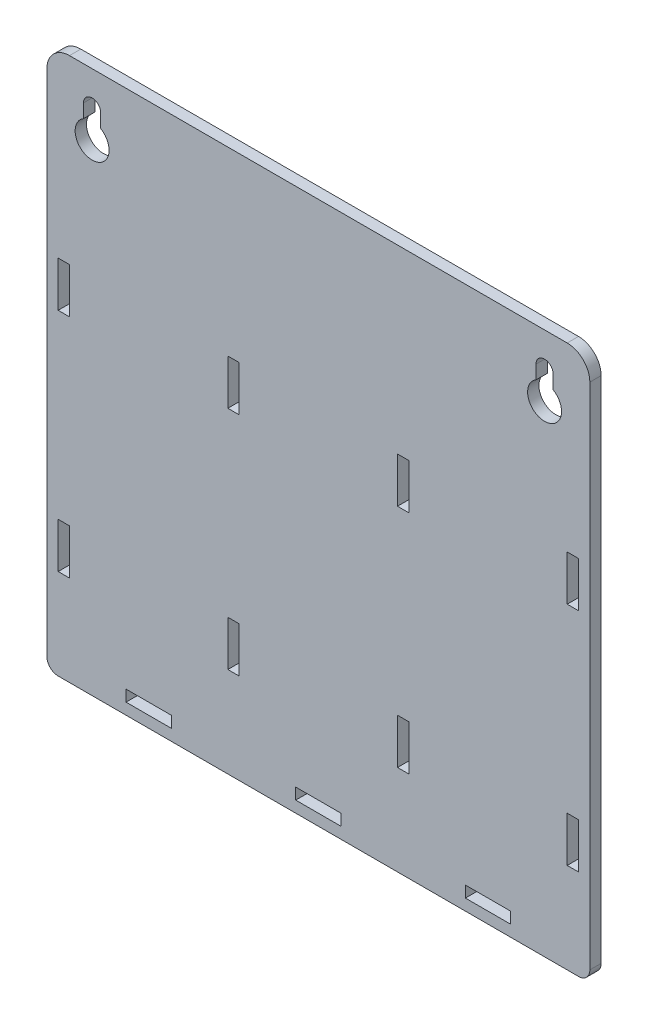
ISO-10303-21;
HEADER;
FILE_DESCRIPTION(('STEP AP214'),'2;1');
FILE_NAME('part.step','',(''),(''),'','','');
FILE_SCHEMA(('AUTOMOTIVE_DESIGN { 1 0 10303 214 1 1 1 1 }'));
ENDSEC;
DATA;
#1=APPLICATION_CONTEXT('core data for automotive mechanical design processes');
#2=APPLICATION_PROTOCOL_DEFINITION('international standard','automotive_design',2000,#1);
#3=PRODUCT_CONTEXT('',#1,'mechanical');
#4=PRODUCT('Part','Part','',(#3));
#5=PRODUCT_RELATED_PRODUCT_CATEGORY('part','',(#4));
#6=PRODUCT_DEFINITION_FORMATION('','',#4);
#7=PRODUCT_DEFINITION_CONTEXT('part definition',#1,'design');
#8=PRODUCT_DEFINITION('design','',#6,#7);
#9=PRODUCT_DEFINITION_SHAPE('','',#8);
#10=(LENGTH_UNIT() NAMED_UNIT(*) SI_UNIT(.MILLI.,.METRE.));
#11=(NAMED_UNIT(*) PLANE_ANGLE_UNIT() SI_UNIT($,.RADIAN.));
#12=(NAMED_UNIT(*) SI_UNIT($,.STERADIAN.) SOLID_ANGLE_UNIT());
#13=UNCERTAINTY_MEASURE_WITH_UNIT(LENGTH_MEASURE(1.E-05),#10,'distance_accuracy_value','');
#14=(GEOMETRIC_REPRESENTATION_CONTEXT(3) GLOBAL_UNCERTAINTY_ASSIGNED_CONTEXT((#13)) GLOBAL_UNIT_ASSIGNED_CONTEXT((#10,
#11,#12)) REPRESENTATION_CONTEXT('',''));
#15=CARTESIAN_POINT('',(0.,0.,0.));
#16=DIRECTION('',(0.,0.,1.));
#17=DIRECTION('',(1.,0.,0.));
#18=AXIS2_PLACEMENT_3D('',#15,#16,#17);
#19=CARTESIAN_POINT('',(69.85,146.05,-3.175));
#20=DIRECTION('',(0.,0.,1.));
#21=DIRECTION('',(1.,0.,0.));
#22=AXIS2_PLACEMENT_3D('',#19,#20,#21);
#23=PLANE('',#22);
#24=DIRECTION('',(1.,0.,0.));
#25=VECTOR('',#24,1.);
#26=CARTESIAN_POINT('',(41.275,3.175,-3.175));
#27=LINE('',#26,#25);
#28=CARTESIAN_POINT('',(41.275,3.175,-3.175));
#29=VERTEX_POINT('',#28);
#30=CARTESIAN_POINT('',(53.975,3.175,-3.175));
#31=VERTEX_POINT('',#30);
#32=EDGE_CURVE('E427',#29,#31,#27,.T.);
#33=ORIENTED_EDGE('',*,*,#32,.T.);
#34=DIRECTION('',(0.,1.,0.));
#35=VECTOR('',#34,1.);
#36=CARTESIAN_POINT('',(53.975,3.175,-3.175));
#37=LINE('',#36,#35);
#38=CARTESIAN_POINT('',(53.975,6.35,-3.175));
#39=VERTEX_POINT('',#38);
#40=EDGE_CURVE('E419',#31,#39,#37,.T.);
#41=ORIENTED_EDGE('',*,*,#40,.T.);
#42=DIRECTION('',(-1.,0.,0.));
#43=VECTOR('',#42,1.);
#44=CARTESIAN_POINT('',(41.275,6.35,-3.175));
#45=LINE('',#44,#43);
#46=CARTESIAN_POINT('',(41.275,6.34999999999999,-3.175));
#47=VERTEX_POINT('',#46);
#48=EDGE_CURVE('E431',#39,#47,#45,.T.);
#49=ORIENTED_EDGE('',*,*,#48,.T.);
#50=DIRECTION('',(0.,-1.,0.));
#51=VECTOR('',#50,1.);
#52=CARTESIAN_POINT('',(41.275,3.175,-3.175));
#53=LINE('',#52,#51);
#54=EDGE_CURVE('E435',#47,#29,#53,.T.);
#55=ORIENTED_EDGE('',*,*,#54,.T.);
#56=EDGE_LOOP('',(#33,#41,#49,#55));
#57=FACE_BOUND('',#56,.T.);
#58=DIRECTION('',(-1.,0.,0.));
#59=VECTOR('',#58,1.);
#60=CARTESIAN_POINT('',(6.35,6.35,-3.175));
#61=LINE('',#60,#59);
#62=CARTESIAN_POINT('',(6.35,6.35,-3.175));
#63=VERTEX_POINT('',#62);
#64=CARTESIAN_POINT('',(-6.35,6.35,-3.175));
#65=VERTEX_POINT('',#64);
#66=EDGE_CURVE('E468',#63,#65,#61,.T.);
#67=ORIENTED_EDGE('',*,*,#66,.T.);
#68=DIRECTION('',(0.,-1.,0.));
#69=VECTOR('',#68,1.);
#70=CARTESIAN_POINT('',(-6.35,3.175,-3.175));
#71=LINE('',#70,#69);
#72=CARTESIAN_POINT('',(-6.35,3.175,-3.175));
#73=VERTEX_POINT('',#72);
#74=EDGE_CURVE('E458',#65,#73,#71,.T.);
#75=ORIENTED_EDGE('',*,*,#74,.T.);
#76=DIRECTION('',(1.,0.,0.));
#77=VECTOR('',#76,1.);
#78=CARTESIAN_POINT('',(6.35,3.175,-3.175));
#79=LINE('',#78,#77);
#80=CARTESIAN_POINT('',(6.34999999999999,3.175,-3.175));
#81=VERTEX_POINT('',#80);
#82=EDGE_CURVE('E461',#73,#81,#79,.T.);
#83=ORIENTED_EDGE('',*,*,#82,.T.);
#84=DIRECTION('',(0.,1.,0.));
#85=VECTOR('',#84,1.);
#86=CARTESIAN_POINT('',(6.35,3.175,-3.175));
#87=LINE('',#86,#85);
#88=EDGE_CURVE('E465',#81,#63,#87,.T.);
#89=ORIENTED_EDGE('',*,*,#88,.T.);
#90=EDGE_LOOP('',(#67,#75,#83,#89));
#91=FACE_BOUND('',#90,.T.);
#92=DIRECTION('',(-1.,0.,0.));
#93=VECTOR('',#92,1.);
#94=CARTESIAN_POINT('',(-41.275,6.35,-3.175));
#95=LINE('',#94,#93);
#96=CARTESIAN_POINT('',(-41.275,6.35,-3.175));
#97=VERTEX_POINT('',#96);
#98=CARTESIAN_POINT('',(-53.975,6.35,-3.175));
#99=VERTEX_POINT('',#98);
#100=EDGE_CURVE('E500',#97,#99,#95,.T.);
#101=ORIENTED_EDGE('',*,*,#100,.T.);
#102=DIRECTION('',(0.,-1.,0.));
#103=VECTOR('',#102,1.);
#104=CARTESIAN_POINT('',(-53.975,3.175,-3.175));
#105=LINE('',#104,#103);
#106=CARTESIAN_POINT('',(-53.975,3.175,-3.175));
#107=VERTEX_POINT('',#106);
#108=EDGE_CURVE('E490',#99,#107,#105,.T.);
#109=ORIENTED_EDGE('',*,*,#108,.T.);
#110=DIRECTION('',(1.,0.,0.));
#111=VECTOR('',#110,1.);
#112=CARTESIAN_POINT('',(-41.275,3.175,-3.175));
#113=LINE('',#112,#111);
#114=CARTESIAN_POINT('',(-41.275,3.17500000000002,-3.175));
#115=VERTEX_POINT('',#114);
#116=EDGE_CURVE('E493',#107,#115,#113,.T.);
#117=ORIENTED_EDGE('',*,*,#116,.T.);
#118=DIRECTION('',(0.,1.,0.));
#119=VECTOR('',#118,1.);
#120=CARTESIAN_POINT('',(-41.275,3.175,-3.175));
#121=LINE('',#120,#119);
#122=EDGE_CURVE('E497',#115,#97,#121,.T.);
#123=ORIENTED_EDGE('',*,*,#122,.T.);
#124=EDGE_LOOP('',(#101,#109,#117,#123));
#125=FACE_BOUND('',#124,.T.);
#126=DIRECTION('',(0.,1.,0.));
#127=VECTOR('',#126,1.);
#128=CARTESIAN_POINT('',(69.85,101.6,-3.175));
#129=LINE('',#128,#127);
#130=CARTESIAN_POINT('',(69.85,88.9,-3.175));
#131=VERTEX_POINT('',#130);
#132=CARTESIAN_POINT('',(69.85,101.6,-3.175));
#133=VERTEX_POINT('',#132);
#134=EDGE_CURVE('E553',#131,#133,#129,.T.);
#135=ORIENTED_EDGE('',*,*,#134,.F.);
#136=DIRECTION('',(-1.,0.,0.));
#137=VECTOR('',#136,1.);
#138=CARTESIAN_POINT('',(73.025,88.9,-3.175));
#139=LINE('',#138,#137);
#140=CARTESIAN_POINT('',(73.025,88.9,-3.175));
#141=VERTEX_POINT('',#140);
#142=EDGE_CURVE('E555',#141,#131,#139,.T.);
#143=ORIENTED_EDGE('',*,*,#142,.F.);
#144=DIRECTION('',(0.,-1.,0.));
#145=VECTOR('',#144,1.);
#146=CARTESIAN_POINT('',(73.025,101.6,-3.175));
#147=LINE('',#146,#145);
#148=CARTESIAN_POINT('',(73.025,101.6,-3.175));
#149=VERTEX_POINT('',#148);
#150=EDGE_CURVE('E558',#149,#141,#147,.T.);
#151=ORIENTED_EDGE('',*,*,#150,.F.);
#152=DIRECTION('',(1.,0.,0.));
#153=VECTOR('',#152,1.);
#154=CARTESIAN_POINT('',(73.025,101.6,-3.175));
#155=LINE('',#154,#153);
#156=EDGE_CURVE('E561',#133,#149,#155,.T.);
#157=ORIENTED_EDGE('',*,*,#156,.F.);
#158=EDGE_LOOP('',(#135,#143,#151,#157));
#159=FACE_BOUND('',#158,.T.);
#160=DIRECTION('',(0.,1.,0.));
#161=VECTOR('',#160,1.);
#162=CARTESIAN_POINT('',(22.225,101.6,-3.175));
#163=LINE('',#162,#161);
#164=CARTESIAN_POINT('',(22.225,88.9,-3.175));
#165=VERTEX_POINT('',#164);
#166=CARTESIAN_POINT('',(22.225,101.6,-3.175));
#167=VERTEX_POINT('',#166);
#168=EDGE_CURVE('E615',#165,#167,#163,.T.);
#169=ORIENTED_EDGE('',*,*,#168,.F.);
#170=DIRECTION('',(-1.,0.,0.));
#171=VECTOR('',#170,1.);
#172=CARTESIAN_POINT('',(25.4,88.9,-3.175));
#173=LINE('',#172,#171);
#174=CARTESIAN_POINT('',(25.4,88.9,-3.175));
#175=VERTEX_POINT('',#174);
#176=EDGE_CURVE('E617',#175,#165,#173,.T.);
#177=ORIENTED_EDGE('',*,*,#176,.F.);
#178=DIRECTION('',(0.,-1.,0.));
#179=VECTOR('',#178,1.);
#180=CARTESIAN_POINT('',(25.4,101.6,-3.175));
#181=LINE('',#180,#179);
#182=CARTESIAN_POINT('',(25.4,101.6,-3.175));
#183=VERTEX_POINT('',#182);
#184=EDGE_CURVE('E620',#183,#175,#181,.T.);
#185=ORIENTED_EDGE('',*,*,#184,.F.);
#186=DIRECTION('',(1.,0.,0.));
#187=VECTOR('',#186,1.);
#188=CARTESIAN_POINT('',(25.4,101.6,-3.175));
#189=LINE('',#188,#187);
#190=EDGE_CURVE('E623',#167,#183,#189,.T.);
#191=ORIENTED_EDGE('',*,*,#190,.F.);
#192=EDGE_LOOP('',(#169,#177,#185,#191));
#193=FACE_BOUND('',#192,.T.);
#194=DIRECTION('',(0.,1.,0.));
#195=VECTOR('',#194,1.);
#196=CARTESIAN_POINT('',(76.2,146.05,-3.175));
#197=LINE('',#196,#195);
#198=CARTESIAN_POINT('',(76.2,3.17500000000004,-3.175));
#199=VERTEX_POINT('',#198);
#200=CARTESIAN_POINT('',(76.2,146.05,-3.175));
#201=VERTEX_POINT('',#200);
#202=EDGE_CURVE('E843',#199,#201,#197,.T.);
#203=ORIENTED_EDGE('',*,*,#202,.F.);
#204=CARTESIAN_POINT('',(73.025,3.17500000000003,-3.175));
#205=DIRECTION('',(0.,0.,1.));
#206=DIRECTION('',(1.,0.,0.));
#207=AXIS2_PLACEMENT_3D('',#204,#205,#206);
#208=CIRCLE('',#207,3.175);
#209=CARTESIAN_POINT('',(73.0249999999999,0.,-3.175));
#210=VERTEX_POINT('',#209);
#211=EDGE_CURVE('E43',#199,#210,#208,.F.);
#212=ORIENTED_EDGE('',*,*,#211,.T.);
#213=DIRECTION('',(1.,0.,0.));
#214=VECTOR('',#213,1.);
#215=CARTESIAN_POINT('',(-76.2,0.,-3.175));
#216=LINE('',#215,#214);
#217=CARTESIAN_POINT('',(-73.025,0.,-3.175));
#218=VERTEX_POINT('',#217);
#219=EDGE_CURVE('E839',#218,#210,#216,.T.);
#220=ORIENTED_EDGE('',*,*,#219,.F.);
#221=CARTESIAN_POINT('',(-73.025,3.17500000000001,-3.175));
#222=DIRECTION('',(0.,0.,1.));
#223=DIRECTION('',(1.,0.,0.));
#224=AXIS2_PLACEMENT_3D('',#221,#222,#223);
#225=CIRCLE('',#224,3.175);
#226=CARTESIAN_POINT('',(-76.2,3.17500000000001,-3.175));
#227=VERTEX_POINT('',#226);
#228=EDGE_CURVE('E50',#218,#227,#225,.F.);
#229=ORIENTED_EDGE('',*,*,#228,.T.);
#230=DIRECTION('',(0.,-1.,0.));
#231=VECTOR('',#230,1.);
#232=CARTESIAN_POINT('',(-76.2,146.05,-3.175));
#233=LINE('',#232,#231);
#234=CARTESIAN_POINT('',(-76.2,146.05,-3.175));
#235=VERTEX_POINT('',#234);
#236=EDGE_CURVE('E837',#235,#227,#233,.T.);
#237=ORIENTED_EDGE('',*,*,#236,.F.);
#238=CARTESIAN_POINT('',(-69.8500000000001,146.05,-3.175));
#239=DIRECTION('',(0.,0.,1.));
#240=DIRECTION('',(1.,0.,0.));
#241=AXIS2_PLACEMENT_3D('',#238,#239,#240);
#242=CIRCLE('',#241,6.34999999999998);
#243=CARTESIAN_POINT('',(-69.8500000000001,152.4,-3.175));
#244=VERTEX_POINT('',#243);
#245=EDGE_CURVE('E851',#244,#235,#242,.T.);
#246=ORIENTED_EDGE('',*,*,#245,.F.);
#247=DIRECTION('',(-1.,0.,0.));
#248=VECTOR('',#247,1.);
#249=CARTESIAN_POINT('',(69.85,152.4,-3.175));
#250=LINE('',#249,#248);
#251=CARTESIAN_POINT('',(69.85,152.4,-3.175));
#252=VERTEX_POINT('',#251);
#253=EDGE_CURVE('E848',#252,#244,#250,.T.);
#254=ORIENTED_EDGE('',*,*,#253,.F.);
#255=CARTESIAN_POINT('',(69.85,146.05,-3.175));
#256=DIRECTION('',(0.,0.,1.));
#257=DIRECTION('',(1.,0.,0.));
#258=AXIS2_PLACEMENT_3D('',#255,#256,#257);
#259=CIRCLE('',#258,6.34999999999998);
#260=EDGE_CURVE('E845',#201,#252,#259,.T.);
#261=ORIENTED_EDGE('',*,*,#260,.F.);
#262=EDGE_LOOP('',(#203,#212,#220,#229,#237,#246,#254,#261));
#263=FACE_BOUND('',#262,.T.);
#264=DIRECTION('',(0.,1.,0.));
#265=VECTOR('',#264,1.);
#266=CARTESIAN_POINT('',(-61.0870000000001,142.875,-3.175));
#267=LINE('',#266,#265);
#268=CARTESIAN_POINT('',(-61.0870000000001,139.043451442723,-3.175));
#269=VERTEX_POINT('',#268);
#270=CARTESIAN_POINT('',(-61.0870000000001,142.875,-3.175));
#271=VERTEX_POINT('',#270);
#272=EDGE_CURVE('E815',#269,#271,#267,.T.);
#273=ORIENTED_EDGE('',*,*,#272,.T.);
#274=CARTESIAN_POINT('',(-63.5,142.875,-3.175));
#275=DIRECTION('',(0.,0.,1.));
#276=DIRECTION('',(1.,0.,0.));
#277=AXIS2_PLACEMENT_3D('',#274,#275,#276);
#278=CIRCLE('',#277,2.413);
#279=CARTESIAN_POINT('',(-65.9130000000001,142.875,-3.175));
#280=VERTEX_POINT('',#279);
#281=EDGE_CURVE('E805',#271,#280,#278,.T.);
#282=ORIENTED_EDGE('',*,*,#281,.T.);
#283=DIRECTION('',(0.,-1.,0.));
#284=VECTOR('',#283,1.);
#285=CARTESIAN_POINT('',(-65.9130000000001,142.875,-3.175));
#286=LINE('',#285,#284);
#287=CARTESIAN_POINT('',(-65.9130000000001,139.043451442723,-3.175));
#288=VERTEX_POINT('',#287);
#289=EDGE_CURVE('E808',#280,#288,#286,.T.);
#290=ORIENTED_EDGE('',*,*,#289,.T.);
#291=CARTESIAN_POINT('',(-63.5,134.9375,-3.175));
#292=DIRECTION('',(0.,0.,1.));
#293=DIRECTION('',(1.,0.,0.));
#294=AXIS2_PLACEMENT_3D('',#291,#292,#293);
#295=CIRCLE('',#294,4.7625);
#296=EDGE_CURVE('E812',#288,#269,#295,.T.);
#297=ORIENTED_EDGE('',*,*,#296,.T.);
#298=EDGE_LOOP('',(#273,#282,#290,#297));
#299=FACE_BOUND('',#298,.T.);
#300=DIRECTION('',(1.,0.,0.));
#301=VECTOR('',#300,1.);
#302=CARTESIAN_POINT('',(-25.4,88.9,-3.175));
#303=LINE('',#302,#301);
#304=CARTESIAN_POINT('',(-25.4,88.9,-3.175));
#305=VERTEX_POINT('',#304);
#306=CARTESIAN_POINT('',(-22.225,88.9,-3.175));
#307=VERTEX_POINT('',#306);
#308=EDGE_CURVE('E783',#305,#307,#303,.T.);
#309=ORIENTED_EDGE('',*,*,#308,.T.);
#310=DIRECTION('',(0.,1.,0.));
#311=VECTOR('',#310,1.);
#312=CARTESIAN_POINT('',(-22.225,101.6,-3.175));
#313=LINE('',#312,#311);
#314=CARTESIAN_POINT('',(-22.225,101.6,-3.175));
#315=VERTEX_POINT('',#314);
#316=EDGE_CURVE('E773',#307,#315,#313,.T.);
#317=ORIENTED_EDGE('',*,*,#316,.T.);
#318=DIRECTION('',(-1.,0.,0.));
#319=VECTOR('',#318,1.);
#320=CARTESIAN_POINT('',(-25.4,101.6,-3.175));
#321=LINE('',#320,#319);
#322=CARTESIAN_POINT('',(-25.4,101.6,-3.175));
#323=VERTEX_POINT('',#322);
#324=EDGE_CURVE('E776',#315,#323,#321,.T.);
#325=ORIENTED_EDGE('',*,*,#324,.T.);
#326=DIRECTION('',(0.,-1.,0.));
#327=VECTOR('',#326,1.);
#328=CARTESIAN_POINT('',(-25.4,101.6,-3.175));
#329=LINE('',#328,#327);
#330=EDGE_CURVE('E780',#323,#305,#329,.T.);
#331=ORIENTED_EDGE('',*,*,#330,.T.);
#332=EDGE_LOOP('',(#309,#317,#325,#331));
#333=FACE_BOUND('',#332,.T.);
#334=DIRECTION('',(1.,0.,0.));
#335=VECTOR('',#334,1.);
#336=CARTESIAN_POINT('',(-25.4,25.4,-3.175));
#337=LINE('',#336,#335);
#338=CARTESIAN_POINT('',(-25.4,25.4,-3.175));
#339=VERTEX_POINT('',#338);
#340=CARTESIAN_POINT('',(-22.225,25.4,-3.175));
#341=VERTEX_POINT('',#340);
#342=EDGE_CURVE('E751',#339,#341,#337,.T.);
#343=ORIENTED_EDGE('',*,*,#342,.T.);
#344=DIRECTION('',(0.,1.,0.));
#345=VECTOR('',#344,1.);
#346=CARTESIAN_POINT('',(-22.225,38.1,-3.175));
#347=LINE('',#346,#345);
#348=CARTESIAN_POINT('',(-22.225,38.1,-3.175));
#349=VERTEX_POINT('',#348);
#350=EDGE_CURVE('E741',#341,#349,#347,.T.);
#351=ORIENTED_EDGE('',*,*,#350,.T.);
#352=DIRECTION('',(-1.,0.,0.));
#353=VECTOR('',#352,1.);
#354=CARTESIAN_POINT('',(-25.4,38.1,-3.175));
#355=LINE('',#354,#353);
#356=CARTESIAN_POINT('',(-25.4,38.1,-3.175));
#357=VERTEX_POINT('',#356);
#358=EDGE_CURVE('E744',#349,#357,#355,.T.);
#359=ORIENTED_EDGE('',*,*,#358,.T.);
#360=DIRECTION('',(0.,-1.,0.));
#361=VECTOR('',#360,1.);
#362=CARTESIAN_POINT('',(-25.4,38.1,-3.175));
#363=LINE('',#362,#361);
#364=EDGE_CURVE('E748',#357,#339,#363,.T.);
#365=ORIENTED_EDGE('',*,*,#364,.T.);
#366=EDGE_LOOP('',(#343,#351,#359,#365));
#367=FACE_BOUND('',#366,.T.);
#368=DIRECTION('',(1.,0.,0.));
#369=VECTOR('',#368,1.);
#370=CARTESIAN_POINT('',(-73.025,88.9,-3.175));
#371=LINE('',#370,#369);
#372=CARTESIAN_POINT('',(-73.025,88.9,-3.175));
#373=VERTEX_POINT('',#372);
#374=CARTESIAN_POINT('',(-69.85,88.9,-3.175));
#375=VERTEX_POINT('',#374);
#376=EDGE_CURVE('E719',#373,#375,#371,.T.);
#377=ORIENTED_EDGE('',*,*,#376,.T.);
#378=DIRECTION('',(0.,1.,0.));
#379=VECTOR('',#378,1.);
#380=CARTESIAN_POINT('',(-69.85,101.6,-3.175));
#381=LINE('',#380,#379);
#382=CARTESIAN_POINT('',(-69.85,101.6,-3.175));
#383=VERTEX_POINT('',#382);
#384=EDGE_CURVE('E709',#375,#383,#381,.T.);
#385=ORIENTED_EDGE('',*,*,#384,.T.);
#386=DIRECTION('',(-1.,0.,0.));
#387=VECTOR('',#386,1.);
#388=CARTESIAN_POINT('',(-73.025,101.6,-3.175));
#389=LINE('',#388,#387);
#390=CARTESIAN_POINT('',(-73.025,101.6,-3.175));
#391=VERTEX_POINT('',#390);
#392=EDGE_CURVE('E712',#383,#391,#389,.T.);
#393=ORIENTED_EDGE('',*,*,#392,.T.);
#394=DIRECTION('',(0.,-1.,0.));
#395=VECTOR('',#394,1.);
#396=CARTESIAN_POINT('',(-73.025,101.6,-3.175));
#397=LINE('',#396,#395);
#398=EDGE_CURVE('E716',#391,#373,#397,.T.);
#399=ORIENTED_EDGE('',*,*,#398,.T.);
#400=EDGE_LOOP('',(#377,#385,#393,#399));
#401=FACE_BOUND('',#400,.T.);
#402=DIRECTION('',(1.,0.,0.));
#403=VECTOR('',#402,1.);
#404=CARTESIAN_POINT('',(-73.025,25.4,-3.175));
#405=LINE('',#404,#403);
#406=CARTESIAN_POINT('',(-73.025,25.4,-3.175));
#407=VERTEX_POINT('',#406);
#408=CARTESIAN_POINT('',(-69.85,25.4,-3.175));
#409=VERTEX_POINT('',#408);
#410=EDGE_CURVE('E687',#407,#409,#405,.T.);
#411=ORIENTED_EDGE('',*,*,#410,.T.);
#412=DIRECTION('',(0.,1.,0.));
#413=VECTOR('',#412,1.);
#414=CARTESIAN_POINT('',(-69.85,38.1,-3.175));
#415=LINE('',#414,#413);
#416=CARTESIAN_POINT('',(-69.85,38.1,-3.175));
#417=VERTEX_POINT('',#416);
#418=EDGE_CURVE('E677',#409,#417,#415,.T.);
#419=ORIENTED_EDGE('',*,*,#418,.T.);
#420=DIRECTION('',(-1.,0.,0.));
#421=VECTOR('',#420,1.);
#422=CARTESIAN_POINT('',(-73.025,38.1,-3.175));
#423=LINE('',#422,#421);
#424=CARTESIAN_POINT('',(-73.025,38.1,-3.175));
#425=VERTEX_POINT('',#424);
#426=EDGE_CURVE('E680',#417,#425,#423,.T.);
#427=ORIENTED_EDGE('',*,*,#426,.T.);
#428=DIRECTION('',(0.,-1.,0.));
#429=VECTOR('',#428,1.);
#430=CARTESIAN_POINT('',(-73.025,38.1,-3.175));
#431=LINE('',#430,#429);
#432=EDGE_CURVE('E684',#425,#407,#431,.T.);
#433=ORIENTED_EDGE('',*,*,#432,.T.);
#434=EDGE_LOOP('',(#411,#419,#427,#433));
#435=FACE_BOUND('',#434,.T.);
#436=CARTESIAN_POINT('',(63.5,142.875,-3.175));
#437=DIRECTION('',(0.,0.,-1.));
#438=DIRECTION('',(-1.,0.,0.));
#439=AXIS2_PLACEMENT_3D('',#436,#437,#438);
#440=CIRCLE('',#439,2.413);
#441=CARTESIAN_POINT('',(61.0870000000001,142.875,-3.175));
#442=VERTEX_POINT('',#441);
#443=CARTESIAN_POINT('',(65.9130000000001,142.875,-3.175));
#444=VERTEX_POINT('',#443);
#445=EDGE_CURVE('E646',#442,#444,#440,.T.);
#446=ORIENTED_EDGE('',*,*,#445,.F.);
#447=DIRECTION('',(0.,1.,0.));
#448=VECTOR('',#447,1.);
#449=CARTESIAN_POINT('',(61.0870000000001,142.875,-3.175));
#450=LINE('',#449,#448);
#451=CARTESIAN_POINT('',(61.0870000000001,139.043451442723,-3.175));
#452=VERTEX_POINT('',#451);
#453=EDGE_CURVE('E648',#452,#442,#450,.T.);
#454=ORIENTED_EDGE('',*,*,#453,.F.);
#455=CARTESIAN_POINT('',(63.5,134.9375,-3.175));
#456=DIRECTION('',(0.,0.,-1.));
#457=DIRECTION('',(-1.,0.,0.));
#458=AXIS2_PLACEMENT_3D('',#455,#456,#457);
#459=CIRCLE('',#458,4.7625);
#460=CARTESIAN_POINT('',(65.9130000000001,139.043451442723,-3.175));
#461=VERTEX_POINT('',#460);
#462=EDGE_CURVE('E651',#461,#452,#459,.T.);
#463=ORIENTED_EDGE('',*,*,#462,.F.);
#464=DIRECTION('',(0.,-1.,0.));
#465=VECTOR('',#464,1.);
#466=CARTESIAN_POINT('',(65.9130000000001,142.875,-3.175));
#467=LINE('',#466,#465);
#468=EDGE_CURVE('E654',#444,#461,#467,.T.);
#469=ORIENTED_EDGE('',*,*,#468,.F.);
#470=EDGE_LOOP('',(#446,#454,#463,#469));
#471=FACE_BOUND('',#470,.T.);
#472=DIRECTION('',(0.,1.,0.));
#473=VECTOR('',#472,1.);
#474=CARTESIAN_POINT('',(22.225,38.1,-3.175));
#475=LINE('',#474,#473);
#476=CARTESIAN_POINT('',(22.225,25.4,-3.175));
#477=VERTEX_POINT('',#476);
#478=CARTESIAN_POINT('',(22.225,38.1,-3.175));
#479=VERTEX_POINT('',#478);
#480=EDGE_CURVE('E584',#477,#479,#475,.T.);
#481=ORIENTED_EDGE('',*,*,#480,.F.);
#482=DIRECTION('',(-1.,0.,0.));
#483=VECTOR('',#482,1.);
#484=CARTESIAN_POINT('',(25.4,25.4,-3.175));
#485=LINE('',#484,#483);
#486=CARTESIAN_POINT('',(25.4,25.4,-3.175));
#487=VERTEX_POINT('',#486);
#488=EDGE_CURVE('E586',#487,#477,#485,.T.);
#489=ORIENTED_EDGE('',*,*,#488,.F.);
#490=DIRECTION('',(0.,-1.,0.));
#491=VECTOR('',#490,1.);
#492=CARTESIAN_POINT('',(25.4,38.1,-3.175));
#493=LINE('',#492,#491);
#494=CARTESIAN_POINT('',(25.4,38.1,-3.175));
#495=VERTEX_POINT('',#494);
#496=EDGE_CURVE('E589',#495,#487,#493,.T.);
#497=ORIENTED_EDGE('',*,*,#496,.F.);
#498=DIRECTION('',(1.,0.,0.));
#499=VECTOR('',#498,1.);
#500=CARTESIAN_POINT('',(25.4,38.1,-3.175));
#501=LINE('',#500,#499);
#502=EDGE_CURVE('E592',#479,#495,#501,.T.);
#503=ORIENTED_EDGE('',*,*,#502,.F.);
#504=EDGE_LOOP('',(#481,#489,#497,#503));
#505=FACE_BOUND('',#504,.T.);
#506=DIRECTION('',(0.,1.,0.));
#507=VECTOR('',#506,1.);
#508=CARTESIAN_POINT('',(69.85,38.1,-3.175));
#509=LINE('',#508,#507);
#510=CARTESIAN_POINT('',(69.85,25.4,-3.175));
#511=VERTEX_POINT('',#510);
#512=CARTESIAN_POINT('',(69.85,38.1,-3.175));
#513=VERTEX_POINT('',#512);
#514=EDGE_CURVE('E522',#511,#513,#509,.T.);
#515=ORIENTED_EDGE('',*,*,#514,.F.);
#516=DIRECTION('',(-1.,0.,0.));
#517=VECTOR('',#516,1.);
#518=CARTESIAN_POINT('',(73.025,25.4,-3.175));
#519=LINE('',#518,#517);
#520=CARTESIAN_POINT('',(73.025,25.4,-3.175));
#521=VERTEX_POINT('',#520);
#522=EDGE_CURVE('E524',#521,#511,#519,.T.);
#523=ORIENTED_EDGE('',*,*,#522,.F.);
#524=DIRECTION('',(0.,-1.,0.));
#525=VECTOR('',#524,1.);
#526=CARTESIAN_POINT('',(73.025,38.1,-3.175));
#527=LINE('',#526,#525);
#528=CARTESIAN_POINT('',(73.025,38.1,-3.175));
#529=VERTEX_POINT('',#528);
#530=EDGE_CURVE('E527',#529,#521,#527,.T.);
#531=ORIENTED_EDGE('',*,*,#530,.F.);
#532=DIRECTION('',(1.,0.,0.));
#533=VECTOR('',#532,1.);
#534=CARTESIAN_POINT('',(73.025,38.1,-3.175));
#535=LINE('',#534,#533);
#536=EDGE_CURVE('E530',#513,#529,#535,.T.);
#537=ORIENTED_EDGE('',*,*,#536,.F.);
#538=EDGE_LOOP('',(#515,#523,#531,#537));
#539=FACE_BOUND('',#538,.T.);
#540=ADVANCED_FACE('F35',(#57,#91,#125,#159,#193,#263,#299,#333,#367,#401,#435,#471,#505,#539),
#23,.F.);
#541=CARTESIAN_POINT('',(69.85,146.05,0.));
#542=DIRECTION('',(0.,0.,1.));
#543=DIRECTION('',(1.,0.,0.));
#544=AXIS2_PLACEMENT_3D('',#541,#542,#543);
#545=PLANE('',#544);
#546=DIRECTION('',(0.,1.,0.));
#547=VECTOR('',#546,1.);
#548=CARTESIAN_POINT('',(53.975,3.175,0.));
#549=LINE('',#548,#547);
#550=CARTESIAN_POINT('',(53.975,3.175,0.));
#551=VERTEX_POINT('',#550);
#552=CARTESIAN_POINT('',(53.975,6.34999999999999,0.));
#553=VERTEX_POINT('',#552);
#554=EDGE_CURVE('E422',#551,#553,#549,.T.);
#555=ORIENTED_EDGE('',*,*,#554,.F.);
#556=DIRECTION('',(1.,0.,0.));
#557=VECTOR('',#556,1.);
#558=CARTESIAN_POINT('',(41.275,3.175,0.));
#559=LINE('',#558,#557);
#560=CARTESIAN_POINT('',(41.275,3.175,0.));
#561=VERTEX_POINT('',#560);
#562=EDGE_CURVE('E439',#561,#551,#559,.T.);
#563=ORIENTED_EDGE('',*,*,#562,.F.);
#564=DIRECTION('',(0.,-1.,0.));
#565=VECTOR('',#564,1.);
#566=CARTESIAN_POINT('',(41.275,3.175,0.));
#567=LINE('',#566,#565);
#568=CARTESIAN_POINT('',(41.275,6.35,0.));
#569=VERTEX_POINT('',#568);
#570=EDGE_CURVE('E442',#569,#561,#567,.T.);
#571=ORIENTED_EDGE('',*,*,#570,.F.);
#572=DIRECTION('',(-1.,0.,0.));
#573=VECTOR('',#572,1.);
#574=CARTESIAN_POINT('',(41.275,6.35,0.));
#575=LINE('',#574,#573);
#576=EDGE_CURVE('E448',#553,#569,#575,.T.);
#577=ORIENTED_EDGE('',*,*,#576,.F.);
#578=EDGE_LOOP('',(#555,#563,#571,#577));
#579=FACE_BOUND('',#578,.T.);
#580=DIRECTION('',(0.,-1.,0.));
#581=VECTOR('',#580,1.);
#582=CARTESIAN_POINT('',(-6.35,3.175,0.));
#583=LINE('',#582,#581);
#584=CARTESIAN_POINT('',(-6.35,6.35,0.));
#585=VERTEX_POINT('',#584);
#586=CARTESIAN_POINT('',(-6.34999999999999,3.175,0.));
#587=VERTEX_POINT('',#586);
#588=EDGE_CURVE('E454',#585,#587,#583,.T.);
#589=ORIENTED_EDGE('',*,*,#588,.F.);
#590=DIRECTION('',(-1.,0.,0.));
#591=VECTOR('',#590,1.);
#592=CARTESIAN_POINT('',(6.35,6.35,0.));
#593=LINE('',#592,#591);
#594=CARTESIAN_POINT('',(6.35,6.35,0.));
#595=VERTEX_POINT('',#594);
#596=EDGE_CURVE('E462',#595,#585,#593,.T.);
#597=ORIENTED_EDGE('',*,*,#596,.F.);
#598=DIRECTION('',(0.,1.,0.));
#599=VECTOR('',#598,1.);
#600=CARTESIAN_POINT('',(6.35,3.175,0.));
#601=LINE('',#600,#599);
#602=CARTESIAN_POINT('',(6.35,3.175,0.));
#603=VERTEX_POINT('',#602);
#604=EDGE_CURVE('E476',#603,#595,#601,.T.);
#605=ORIENTED_EDGE('',*,*,#604,.F.);
#606=DIRECTION('',(1.,0.,0.));
#607=VECTOR('',#606,1.);
#608=CARTESIAN_POINT('',(6.35,3.175,0.));
#609=LINE('',#608,#607);
#610=EDGE_CURVE('E473',#587,#603,#609,.T.);
#611=ORIENTED_EDGE('',*,*,#610,.F.);
#612=EDGE_LOOP('',(#589,#597,#605,#611));
#613=FACE_BOUND('',#612,.T.);
#614=DIRECTION('',(0.,-1.,0.));
#615=VECTOR('',#614,1.);
#616=CARTESIAN_POINT('',(-53.975,3.175,0.));
#617=LINE('',#616,#615);
#618=CARTESIAN_POINT('',(-53.975,6.35,0.));
#619=VERTEX_POINT('',#618);
#620=CARTESIAN_POINT('',(-53.975,3.17500000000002,0.));
#621=VERTEX_POINT('',#620);
#622=EDGE_CURVE('E483',#619,#621,#617,.T.);
#623=ORIENTED_EDGE('',*,*,#622,.F.);
#624=DIRECTION('',(-1.,0.,0.));
#625=VECTOR('',#624,1.);
#626=CARTESIAN_POINT('',(-41.275,6.35,0.));
#627=LINE('',#626,#625);
#628=CARTESIAN_POINT('',(-41.275,6.35,0.));
#629=VERTEX_POINT('',#628);
#630=EDGE_CURVE('E494',#629,#619,#627,.T.);
#631=ORIENTED_EDGE('',*,*,#630,.F.);
#632=DIRECTION('',(0.,1.,0.));
#633=VECTOR('',#632,1.);
#634=CARTESIAN_POINT('',(-41.275,3.175,0.));
#635=LINE('',#634,#633);
#636=CARTESIAN_POINT('',(-41.275,3.175,0.));
#637=VERTEX_POINT('',#636);
#638=EDGE_CURVE('E508',#637,#629,#635,.T.);
#639=ORIENTED_EDGE('',*,*,#638,.F.);
#640=DIRECTION('',(1.,0.,0.));
#641=VECTOR('',#640,1.);
#642=CARTESIAN_POINT('',(-41.275,3.175,0.));
#643=LINE('',#642,#641);
#644=EDGE_CURVE('E505',#621,#637,#643,.T.);
#645=ORIENTED_EDGE('',*,*,#644,.F.);
#646=EDGE_LOOP('',(#623,#631,#639,#645));
#647=FACE_BOUND('',#646,.T.);
#648=DIRECTION('',(0.,1.,0.));
#649=VECTOR('',#648,1.);
#650=CARTESIAN_POINT('',(-69.85,38.1,0.));
#651=LINE('',#650,#649);
#652=CARTESIAN_POINT('',(-69.85,25.4,0.));
#653=VERTEX_POINT('',#652);
#654=CARTESIAN_POINT('',(-69.85,38.1,0.));
#655=VERTEX_POINT('',#654);
#656=EDGE_CURVE('E670',#653,#655,#651,.T.);
#657=ORIENTED_EDGE('',*,*,#656,.F.);
#658=DIRECTION('',(1.,0.,0.));
#659=VECTOR('',#658,1.);
#660=CARTESIAN_POINT('',(-73.025,25.4,0.));
#661=LINE('',#660,#659);
#662=CARTESIAN_POINT('',(-73.025,25.4,0.));
#663=VERTEX_POINT('',#662);
#664=EDGE_CURVE('E681',#663,#653,#661,.T.);
#665=ORIENTED_EDGE('',*,*,#664,.F.);
#666=DIRECTION('',(0.,-1.,0.));
#667=VECTOR('',#666,1.);
#668=CARTESIAN_POINT('',(-73.025,38.1,0.));
#669=LINE('',#668,#667);
#670=CARTESIAN_POINT('',(-73.025,38.1,0.));
#671=VERTEX_POINT('',#670);
#672=EDGE_CURVE('E695',#671,#663,#669,.T.);
#673=ORIENTED_EDGE('',*,*,#672,.F.);
#674=DIRECTION('',(-1.,0.,0.));
#675=VECTOR('',#674,1.);
#676=CARTESIAN_POINT('',(-73.025,38.1,0.));
#677=LINE('',#676,#675);
#678=EDGE_CURVE('E692',#655,#671,#677,.T.);
#679=ORIENTED_EDGE('',*,*,#678,.F.);
#680=EDGE_LOOP('',(#657,#665,#673,#679));
#681=FACE_BOUND('',#680,.T.);
#682=DIRECTION('',(0.,1.,0.));
#683=VECTOR('',#682,1.);
#684=CARTESIAN_POINT('',(-69.85,101.6,0.));
#685=LINE('',#684,#683);
#686=CARTESIAN_POINT('',(-69.85,88.9,0.));
#687=VERTEX_POINT('',#686);
#688=CARTESIAN_POINT('',(-69.85,101.6,0.));
#689=VERTEX_POINT('',#688);
#690=EDGE_CURVE('E702',#687,#689,#685,.T.);
#691=ORIENTED_EDGE('',*,*,#690,.F.);
#692=DIRECTION('',(1.,0.,0.));
#693=VECTOR('',#692,1.);
#694=CARTESIAN_POINT('',(-73.025,88.9,0.));
#695=LINE('',#694,#693);
#696=CARTESIAN_POINT('',(-73.025,88.9,0.));
#697=VERTEX_POINT('',#696);
#698=EDGE_CURVE('E713',#697,#687,#695,.T.);
#699=ORIENTED_EDGE('',*,*,#698,.F.);
#700=DIRECTION('',(0.,-1.,0.));
#701=VECTOR('',#700,1.);
#702=CARTESIAN_POINT('',(-73.025,101.6,0.));
#703=LINE('',#702,#701);
#704=CARTESIAN_POINT('',(-73.025,101.6,0.));
#705=VERTEX_POINT('',#704);
#706=EDGE_CURVE('E727',#705,#697,#703,.T.);
#707=ORIENTED_EDGE('',*,*,#706,.F.);
#708=DIRECTION('',(-1.,0.,0.));
#709=VECTOR('',#708,1.);
#710=CARTESIAN_POINT('',(-73.025,101.6,0.));
#711=LINE('',#710,#709);
#712=EDGE_CURVE('E724',#689,#705,#711,.T.);
#713=ORIENTED_EDGE('',*,*,#712,.F.);
#714=EDGE_LOOP('',(#691,#699,#707,#713));
#715=FACE_BOUND('',#714,.T.);
#716=DIRECTION('',(0.,1.,0.));
#717=VECTOR('',#716,1.);
#718=CARTESIAN_POINT('',(-22.225,38.1,0.));
#719=LINE('',#718,#717);
#720=CARTESIAN_POINT('',(-22.225,25.4,0.));
#721=VERTEX_POINT('',#720);
#722=CARTESIAN_POINT('',(-22.225,38.1,0.));
#723=VERTEX_POINT('',#722);
#724=EDGE_CURVE('E734',#721,#723,#719,.T.);
#725=ORIENTED_EDGE('',*,*,#724,.F.);
#726=DIRECTION('',(1.,0.,0.));
#727=VECTOR('',#726,1.);
#728=CARTESIAN_POINT('',(-25.4,25.4,0.));
#729=LINE('',#728,#727);
#730=CARTESIAN_POINT('',(-25.4,25.4,0.));
#731=VERTEX_POINT('',#730);
#732=EDGE_CURVE('E745',#731,#721,#729,.T.);
#733=ORIENTED_EDGE('',*,*,#732,.F.);
#734=DIRECTION('',(0.,-1.,0.));
#735=VECTOR('',#734,1.);
#736=CARTESIAN_POINT('',(-25.4,38.1,0.));
#737=LINE('',#736,#735);
#738=CARTESIAN_POINT('',(-25.4,38.1,0.));
#739=VERTEX_POINT('',#738);
#740=EDGE_CURVE('E759',#739,#731,#737,.T.);
#741=ORIENTED_EDGE('',*,*,#740,.F.);
#742=DIRECTION('',(-1.,0.,0.));
#743=VECTOR('',#742,1.);
#744=CARTESIAN_POINT('',(-25.4,38.1,0.));
#745=LINE('',#744,#743);
#746=EDGE_CURVE('E756',#723,#739,#745,.T.);
#747=ORIENTED_EDGE('',*,*,#746,.F.);
#748=EDGE_LOOP('',(#725,#733,#741,#747));
#749=FACE_BOUND('',#748,.T.);
#750=DIRECTION('',(0.,1.,0.));
#751=VECTOR('',#750,1.);
#752=CARTESIAN_POINT('',(-22.225,101.6,0.));
#753=LINE('',#752,#751);
#754=CARTESIAN_POINT('',(-22.225,88.9,0.));
#755=VERTEX_POINT('',#754);
#756=CARTESIAN_POINT('',(-22.225,101.6,0.));
#757=VERTEX_POINT('',#756);
#758=EDGE_CURVE('E766',#755,#757,#753,.T.);
#759=ORIENTED_EDGE('',*,*,#758,.F.);
#760=DIRECTION('',(1.,0.,0.));
#761=VECTOR('',#760,1.);
#762=CARTESIAN_POINT('',(-25.4,88.9,0.));
#763=LINE('',#762,#761);
#764=CARTESIAN_POINT('',(-25.4,88.9,0.));
#765=VERTEX_POINT('',#764);
#766=EDGE_CURVE('E777',#765,#755,#763,.T.);
#767=ORIENTED_EDGE('',*,*,#766,.F.);
#768=DIRECTION('',(0.,-1.,0.));
#769=VECTOR('',#768,1.);
#770=CARTESIAN_POINT('',(-25.4,101.6,0.));
#771=LINE('',#770,#769);
#772=CARTESIAN_POINT('',(-25.4,101.6,0.));
#773=VERTEX_POINT('',#772);
#774=EDGE_CURVE('E791',#773,#765,#771,.T.);
#775=ORIENTED_EDGE('',*,*,#774,.F.);
#776=DIRECTION('',(-1.,0.,0.));
#777=VECTOR('',#776,1.);
#778=CARTESIAN_POINT('',(-25.4,101.6,0.));
#779=LINE('',#778,#777);
#780=EDGE_CURVE('E788',#757,#773,#779,.T.);
#781=ORIENTED_EDGE('',*,*,#780,.F.);
#782=EDGE_LOOP('',(#759,#767,#775,#781));
#783=FACE_BOUND('',#782,.T.);
#784=CARTESIAN_POINT('',(-63.5,142.875,0.));
#785=DIRECTION('',(0.,0.,1.));
#786=DIRECTION('',(1.,0.,0.));
#787=AXIS2_PLACEMENT_3D('',#784,#785,#786);
#788=CIRCLE('',#787,2.413);
#789=CARTESIAN_POINT('',(-61.0870000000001,142.875,0.));
#790=VERTEX_POINT('',#789);
#791=CARTESIAN_POINT('',(-65.9130000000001,142.875,0.));
#792=VERTEX_POINT('',#791);
#793=EDGE_CURVE('E798',#790,#792,#788,.T.);
#794=ORIENTED_EDGE('',*,*,#793,.F.);
#795=DIRECTION('',(0.,1.,0.));
#796=VECTOR('',#795,1.);
#797=CARTESIAN_POINT('',(-61.0870000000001,142.875,0.));
#798=LINE('',#797,#796);
#799=CARTESIAN_POINT('',(-61.0870000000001,139.043451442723,0.));
#800=VERTEX_POINT('',#799);
#801=EDGE_CURVE('E809',#800,#790,#798,.T.);
#802=ORIENTED_EDGE('',*,*,#801,.F.);
#803=CARTESIAN_POINT('',(-63.5,134.9375,0.));
#804=DIRECTION('',(0.,0.,1.));
#805=DIRECTION('',(1.,0.,0.));
#806=AXIS2_PLACEMENT_3D('',#803,#804,#805);
#807=CIRCLE('',#806,4.7625);
#808=CARTESIAN_POINT('',(-65.9130000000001,139.043451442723,0.));
#809=VERTEX_POINT('',#808);
#810=EDGE_CURVE('E823',#809,#800,#807,.T.);
#811=ORIENTED_EDGE('',*,*,#810,.F.);
#812=DIRECTION('',(0.,-1.,0.));
#813=VECTOR('',#812,1.);
#814=CARTESIAN_POINT('',(-65.9130000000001,142.875,0.));
#815=LINE('',#814,#813);
#816=EDGE_CURVE('E820',#792,#809,#815,.T.);
#817=ORIENTED_EDGE('',*,*,#816,.F.);
#818=EDGE_LOOP('',(#794,#802,#811,#817));
#819=FACE_BOUND('',#818,.T.);
#820=DIRECTION('',(1.,0.,0.));
#821=VECTOR('',#820,1.);
#822=CARTESIAN_POINT('',(-76.2,0.,0.));
#823=LINE('',#822,#821);
#824=CARTESIAN_POINT('',(-73.025,0.,0.));
#825=VERTEX_POINT('',#824);
#826=CARTESIAN_POINT('',(73.0249999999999,0.,0.));
#827=VERTEX_POINT('',#826);
#828=EDGE_CURVE('E857',#825,#827,#823,.T.);
#829=ORIENTED_EDGE('',*,*,#828,.T.);
#830=CARTESIAN_POINT('',(73.025,3.17500000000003,0.));
#831=DIRECTION('',(0.,0.,1.));
#832=DIRECTION('',(1.,0.,0.));
#833=AXIS2_PLACEMENT_3D('',#830,#831,#832);
#834=CIRCLE('',#833,3.175);
#835=CARTESIAN_POINT('',(76.2,3.17500000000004,0.));
#836=VERTEX_POINT('',#835);
#837=EDGE_CURVE('E885',#827,#836,#834,.T.);
#838=ORIENTED_EDGE('',*,*,#837,.T.);
#839=DIRECTION('',(0.,1.,0.));
#840=VECTOR('',#839,1.);
#841=CARTESIAN_POINT('',(76.2,146.05,0.));
#842=LINE('',#841,#840);
#843=CARTESIAN_POINT('',(76.2,146.05,0.));
#844=VERTEX_POINT('',#843);
#845=EDGE_CURVE('E860',#836,#844,#842,.T.);
#846=ORIENTED_EDGE('',*,*,#845,.T.);
#847=CARTESIAN_POINT('',(69.85,146.05,0.));
#848=DIRECTION('',(0.,0.,1.));
#849=DIRECTION('',(1.,0.,0.));
#850=AXIS2_PLACEMENT_3D('',#847,#848,#849);
#851=CIRCLE('',#850,6.34999999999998);
#852=CARTESIAN_POINT('',(69.85,152.4,0.));
#853=VERTEX_POINT('',#852);
#854=EDGE_CURVE('E862',#844,#853,#851,.T.);
#855=ORIENTED_EDGE('',*,*,#854,.T.);
#856=DIRECTION('',(-1.,0.,0.));
#857=VECTOR('',#856,1.);
#858=CARTESIAN_POINT('',(69.85,152.4,0.));
#859=LINE('',#858,#857);
#860=CARTESIAN_POINT('',(-69.8500000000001,152.4,0.));
#861=VERTEX_POINT('',#860);
#862=EDGE_CURVE('E865',#853,#861,#859,.T.);
#863=ORIENTED_EDGE('',*,*,#862,.T.);
#864=CARTESIAN_POINT('',(-69.8500000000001,146.05,0.));
#865=DIRECTION('',(0.,0.,1.));
#866=DIRECTION('',(1.,0.,0.));
#867=AXIS2_PLACEMENT_3D('',#864,#865,#866);
#868=CIRCLE('',#867,6.34999999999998);
#869=CARTESIAN_POINT('',(-76.2,146.05,0.));
#870=VERTEX_POINT('',#869);
#871=EDGE_CURVE('E840',#861,#870,#868,.T.);
#872=ORIENTED_EDGE('',*,*,#871,.T.);
#873=DIRECTION('',(0.,-1.,0.));
#874=VECTOR('',#873,1.);
#875=CARTESIAN_POINT('',(-76.2,146.05,0.));
#876=LINE('',#875,#874);
#877=CARTESIAN_POINT('',(-76.2,3.17500000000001,0.));
#878=VERTEX_POINT('',#877);
#879=EDGE_CURVE('E830',#870,#878,#876,.T.);
#880=ORIENTED_EDGE('',*,*,#879,.T.);
#881=CARTESIAN_POINT('',(-73.025,3.17500000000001,0.));
#882=DIRECTION('',(0.,0.,1.));
#883=DIRECTION('',(1.,0.,0.));
#884=AXIS2_PLACEMENT_3D('',#881,#882,#883);
#885=CIRCLE('',#884,3.175);
#886=EDGE_CURVE('E883',#878,#825,#885,.T.);
#887=ORIENTED_EDGE('',*,*,#886,.T.);
#888=EDGE_LOOP('',(#829,#838,#846,#855,#863,#872,#880,#887));
#889=FACE_BOUND('',#888,.T.);
#890=DIRECTION('',(0.,1.,0.));
#891=VECTOR('',#890,1.);
#892=CARTESIAN_POINT('',(61.0870000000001,142.875,0.));
#893=LINE('',#892,#891);
#894=CARTESIAN_POINT('',(61.0870000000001,139.043451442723,0.));
#895=VERTEX_POINT('',#894);
#896=CARTESIAN_POINT('',(61.0870000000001,142.875,0.));
#897=VERTEX_POINT('',#896);
#898=EDGE_CURVE('E659',#895,#897,#893,.T.);
#899=ORIENTED_EDGE('',*,*,#898,.T.);
#900=CARTESIAN_POINT('',(63.5,142.875,0.));
#901=DIRECTION('',(0.,0.,-1.));
#902=DIRECTION('',(-1.,0.,0.));
#903=AXIS2_PLACEMENT_3D('',#900,#901,#902);
#904=CIRCLE('',#903,2.413);
#905=CARTESIAN_POINT('',(65.9130000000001,142.875,0.));
#906=VERTEX_POINT('',#905);
#907=EDGE_CURVE('E639',#897,#906,#904,.T.);
#908=ORIENTED_EDGE('',*,*,#907,.T.);
#909=DIRECTION('',(0.,-1.,0.));
#910=VECTOR('',#909,1.);
#911=CARTESIAN_POINT('',(65.9130000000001,142.875,0.));
#912=LINE('',#911,#910);
#913=CARTESIAN_POINT('',(65.9130000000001,139.043451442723,0.));
#914=VERTEX_POINT('',#913);
#915=EDGE_CURVE('E649',#906,#914,#912,.T.);
#916=ORIENTED_EDGE('',*,*,#915,.T.);
#917=CARTESIAN_POINT('',(63.5,134.9375,0.));
#918=DIRECTION('',(0.,0.,-1.));
#919=DIRECTION('',(-1.,0.,0.));
#920=AXIS2_PLACEMENT_3D('',#917,#918,#919);
#921=CIRCLE('',#920,4.7625);
#922=EDGE_CURVE('E662',#914,#895,#921,.T.);
#923=ORIENTED_EDGE('',*,*,#922,.T.);
#924=EDGE_LOOP('',(#899,#908,#916,#923));
#925=FACE_BOUND('',#924,.T.);
#926=DIRECTION('',(-1.,0.,0.));
#927=VECTOR('',#926,1.);
#928=CARTESIAN_POINT('',(25.4,88.9,0.));
#929=LINE('',#928,#927);
#930=CARTESIAN_POINT('',(25.4,88.9,0.));
#931=VERTEX_POINT('',#930);
#932=CARTESIAN_POINT('',(22.225,88.9,0.));
#933=VERTEX_POINT('',#932);
#934=EDGE_CURVE('E628',#931,#933,#929,.T.);
#935=ORIENTED_EDGE('',*,*,#934,.T.);
#936=DIRECTION('',(0.,1.,0.));
#937=VECTOR('',#936,1.);
#938=CARTESIAN_POINT('',(22.225,101.6,0.));
#939=LINE('',#938,#937);
#940=CARTESIAN_POINT('',(22.225,101.6,0.));
#941=VERTEX_POINT('',#940);
#942=EDGE_CURVE('E608',#933,#941,#939,.T.);
#943=ORIENTED_EDGE('',*,*,#942,.T.);
#944=DIRECTION('',(1.,0.,0.));
#945=VECTOR('',#944,1.);
#946=CARTESIAN_POINT('',(25.4,101.6,0.));
#947=LINE('',#946,#945);
#948=CARTESIAN_POINT('',(25.4,101.6,0.));
#949=VERTEX_POINT('',#948);
#950=EDGE_CURVE('E618',#941,#949,#947,.T.);
#951=ORIENTED_EDGE('',*,*,#950,.T.);
#952=DIRECTION('',(0.,-1.,0.));
#953=VECTOR('',#952,1.);
#954=CARTESIAN_POINT('',(25.4,101.6,0.));
#955=LINE('',#954,#953);
#956=EDGE_CURVE('E631',#949,#931,#955,.T.);
#957=ORIENTED_EDGE('',*,*,#956,.T.);
#958=EDGE_LOOP('',(#935,#943,#951,#957));
#959=FACE_BOUND('',#958,.T.);
#960=DIRECTION('',(-1.,0.,0.));
#961=VECTOR('',#960,1.);
#962=CARTESIAN_POINT('',(25.4,25.4,0.));
#963=LINE('',#962,#961);
#964=CARTESIAN_POINT('',(25.4,25.4,0.));
#965=VERTEX_POINT('',#964);
#966=CARTESIAN_POINT('',(22.225,25.4,0.));
#967=VERTEX_POINT('',#966);
#968=EDGE_CURVE('E597',#965,#967,#963,.T.);
#969=ORIENTED_EDGE('',*,*,#968,.T.);
#970=DIRECTION('',(0.,1.,0.));
#971=VECTOR('',#970,1.);
#972=CARTESIAN_POINT('',(22.225,38.1,0.));
#973=LINE('',#972,#971);
#974=CARTESIAN_POINT('',(22.225,38.1,0.));
#975=VERTEX_POINT('',#974);
#976=EDGE_CURVE('E577',#967,#975,#973,.T.);
#977=ORIENTED_EDGE('',*,*,#976,.T.);
#978=DIRECTION('',(1.,0.,0.));
#979=VECTOR('',#978,1.);
#980=CARTESIAN_POINT('',(25.4,38.1,0.));
#981=LINE('',#980,#979);
#982=CARTESIAN_POINT('',(25.4,38.1,0.));
#983=VERTEX_POINT('',#982);
#984=EDGE_CURVE('E587',#975,#983,#981,.T.);
#985=ORIENTED_EDGE('',*,*,#984,.T.);
#986=DIRECTION('',(0.,-1.,0.));
#987=VECTOR('',#986,1.);
#988=CARTESIAN_POINT('',(25.4,38.1,0.));
#989=LINE('',#988,#987);
#990=EDGE_CURVE('E600',#983,#965,#989,.T.);
#991=ORIENTED_EDGE('',*,*,#990,.T.);
#992=EDGE_LOOP('',(#969,#977,#985,#991));
#993=FACE_BOUND('',#992,.T.);
#994=DIRECTION('',(-1.,0.,0.));
#995=VECTOR('',#994,1.);
#996=CARTESIAN_POINT('',(73.025,88.9,0.));
#997=LINE('',#996,#995);
#998=CARTESIAN_POINT('',(73.025,88.9,0.));
#999=VERTEX_POINT('',#998);
#1000=CARTESIAN_POINT('',(69.85,88.9,0.));
#1001=VERTEX_POINT('',#1000);
#1002=EDGE_CURVE('E566',#999,#1001,#997,.T.);
#1003=ORIENTED_EDGE('',*,*,#1002,.T.);
#1004=DIRECTION('',(0.,1.,0.));
#1005=VECTOR('',#1004,1.);
#1006=CARTESIAN_POINT('',(69.85,101.6,0.));
#1007=LINE('',#1006,#1005);
#1008=CARTESIAN_POINT('',(69.85,101.6,0.));
#1009=VERTEX_POINT('',#1008);
#1010=EDGE_CURVE('E546',#1001,#1009,#1007,.T.);
#1011=ORIENTED_EDGE('',*,*,#1010,.T.);
#1012=DIRECTION('',(1.,0.,0.));
#1013=VECTOR('',#1012,1.);
#1014=CARTESIAN_POINT('',(73.025,101.6,0.));
#1015=LINE('',#1014,#1013);
#1016=CARTESIAN_POINT('',(73.025,101.6,0.));
#1017=VERTEX_POINT('',#1016);
#1018=EDGE_CURVE('E556',#1009,#1017,#1015,.T.);
#1019=ORIENTED_EDGE('',*,*,#1018,.T.);
#1020=DIRECTION('',(0.,-1.,0.));
#1021=VECTOR('',#1020,1.);
#1022=CARTESIAN_POINT('',(73.025,101.6,0.));
#1023=LINE('',#1022,#1021);
#1024=EDGE_CURVE('E569',#1017,#999,#1023,.T.);
#1025=ORIENTED_EDGE('',*,*,#1024,.T.);
#1026=EDGE_LOOP('',(#1003,#1011,#1019,#1025));
#1027=FACE_BOUND('',#1026,.T.);
#1028=DIRECTION('',(-1.,0.,0.));
#1029=VECTOR('',#1028,1.);
#1030=CARTESIAN_POINT('',(73.025,25.4,0.));
#1031=LINE('',#1030,#1029);
#1032=CARTESIAN_POINT('',(73.025,25.4,0.));
#1033=VERTEX_POINT('',#1032);
#1034=CARTESIAN_POINT('',(69.85,25.4,0.));
#1035=VERTEX_POINT('',#1034);
#1036=EDGE_CURVE('E535',#1033,#1035,#1031,.T.);
#1037=ORIENTED_EDGE('',*,*,#1036,.T.);
#1038=DIRECTION('',(0.,1.,0.));
#1039=VECTOR('',#1038,1.);
#1040=CARTESIAN_POINT('',(69.85,38.1,0.));
#1041=LINE('',#1040,#1039);
#1042=CARTESIAN_POINT('',(69.85,38.1,0.));
#1043=VERTEX_POINT('',#1042);
#1044=EDGE_CURVE('E515',#1035,#1043,#1041,.T.);
#1045=ORIENTED_EDGE('',*,*,#1044,.T.);
#1046=DIRECTION('',(1.,0.,0.));
#1047=VECTOR('',#1046,1.);
#1048=CARTESIAN_POINT('',(73.025,38.1,0.));
#1049=LINE('',#1048,#1047);
#1050=CARTESIAN_POINT('',(73.025,38.1,0.));
#1051=VERTEX_POINT('',#1050);
#1052=EDGE_CURVE('E525',#1043,#1051,#1049,.T.);
#1053=ORIENTED_EDGE('',*,*,#1052,.T.);
#1054=DIRECTION('',(0.,-1.,0.));
#1055=VECTOR('',#1054,1.);
#1056=CARTESIAN_POINT('',(73.025,38.1,0.));
#1057=LINE('',#1056,#1055);
#1058=EDGE_CURVE('E538',#1051,#1033,#1057,.T.);
#1059=ORIENTED_EDGE('',*,*,#1058,.T.);
#1060=EDGE_LOOP('',(#1037,#1045,#1053,#1059));
#1061=FACE_BOUND('',#1060,.T.);
#1062=ADVANCED_FACE('F899',(#579,#613,#647,#681,#715,#749,#783,#819,#889,#925,#959,#993,#1027,
#1061),#545,.T.);
#1063=CARTESIAN_POINT('',(-76.2,146.05,-3.175));
#1064=DIRECTION('',(-1.,0.,0.));
#1065=DIRECTION('',(0.,-1.,0.));
#1066=AXIS2_PLACEMENT_3D('',#1063,#1064,#1065);
#1067=PLANE('',#1066);
#1068=ORIENTED_EDGE('',*,*,#236,.T.);
#1069=DIRECTION('',(0.,0.,1.));
#1070=VECTOR('',#1069,1.);
#1071=CARTESIAN_POINT('',(-76.2,3.17500000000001,-3.175));
#1072=LINE('',#1071,#1070);
#1073=EDGE_CURVE('E11',#227,#878,#1072,.T.);
#1074=ORIENTED_EDGE('',*,*,#1073,.T.);
#1075=ORIENTED_EDGE('',*,*,#879,.F.);
#1076=DIRECTION('',(0.,0.,1.));
#1077=VECTOR('',#1076,1.);
#1078=CARTESIAN_POINT('',(-76.2,146.05,-3.175));
#1079=LINE('',#1078,#1077);
#1080=EDGE_CURVE('E870',#235,#870,#1079,.T.);
#1081=ORIENTED_EDGE('',*,*,#1080,.F.);
#1082=EDGE_LOOP('',(#1068,#1074,#1075,#1081));
#1083=FACE_BOUND('',#1082,.T.);
#1084=ADVANCED_FACE('F914',(#1083),#1067,.T.);
#1085=CARTESIAN_POINT('',(-69.8500000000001,146.05,-3.175));
#1086=DIRECTION('',(0.,0.,1.));
#1087=DIRECTION('',(1.,0.,0.));
#1088=AXIS2_PLACEMENT_3D('',#1085,#1086,#1087);
#1089=CYLINDRICAL_SURFACE('',#1088,6.34999999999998);
#1090=ORIENTED_EDGE('',*,*,#871,.F.);
#1091=DIRECTION('',(0.,0.,1.));
#1092=VECTOR('',#1091,1.);
#1093=CARTESIAN_POINT('',(-69.8500000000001,152.4,-3.175));
#1094=LINE('',#1093,#1092);
#1095=EDGE_CURVE('E873',#244,#861,#1094,.T.);
#1096=ORIENTED_EDGE('',*,*,#1095,.F.);
#1097=ORIENTED_EDGE('',*,*,#245,.T.);
#1098=ORIENTED_EDGE('',*,*,#1080,.T.);
#1099=EDGE_LOOP('',(#1090,#1096,#1097,#1098));
#1100=FACE_BOUND('',#1099,.T.);
#1101=ADVANCED_FACE('F910',(#1100),#1089,.T.);
#1102=CARTESIAN_POINT('',(69.85,152.4,-3.175));
#1103=DIRECTION('',(0.,1.,0.));
#1104=DIRECTION('',(-1.,0.,0.));
#1105=AXIS2_PLACEMENT_3D('',#1102,#1103,#1104);
#1106=PLANE('',#1105);
#1107=ORIENTED_EDGE('',*,*,#862,.F.);
#1108=DIRECTION('',(0.,0.,1.));
#1109=VECTOR('',#1108,1.);
#1110=CARTESIAN_POINT('',(69.85,152.4,-3.175));
#1111=LINE('',#1110,#1109);
#1112=EDGE_CURVE('E875',#252,#853,#1111,.T.);
#1113=ORIENTED_EDGE('',*,*,#1112,.F.);
#1114=ORIENTED_EDGE('',*,*,#253,.T.);
#1115=ORIENTED_EDGE('',*,*,#1095,.T.);
#1116=EDGE_LOOP('',(#1107,#1113,#1114,#1115));
#1117=FACE_BOUND('',#1116,.T.);
#1118=ADVANCED_FACE('F934',(#1117),#1106,.T.);
#1119=CARTESIAN_POINT('',(69.85,146.05,-3.175));
#1120=DIRECTION('',(0.,0.,1.));
#1121=DIRECTION('',(1.,0.,0.));
#1122=AXIS2_PLACEMENT_3D('',#1119,#1120,#1121);
#1123=CYLINDRICAL_SURFACE('',#1122,6.34999999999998);
#1124=ORIENTED_EDGE('',*,*,#854,.F.);
#1125=DIRECTION('',(0.,0.,1.));
#1126=VECTOR('',#1125,1.);
#1127=CARTESIAN_POINT('',(76.2,146.05,-3.175));
#1128=LINE('',#1127,#1126);
#1129=EDGE_CURVE('E854',#201,#844,#1128,.T.);
#1130=ORIENTED_EDGE('',*,*,#1129,.F.);
#1131=ORIENTED_EDGE('',*,*,#260,.T.);
#1132=ORIENTED_EDGE('',*,*,#1112,.T.);
#1133=EDGE_LOOP('',(#1124,#1130,#1131,#1132));
#1134=FACE_BOUND('',#1133,.T.);
#1135=ADVANCED_FACE('F905',(#1134),#1123,.T.);
#1136=CARTESIAN_POINT('',(76.2,146.05,-3.175));
#1137=DIRECTION('',(1.,0.,0.));
#1138=DIRECTION('',(0.,1.,0.));
#1139=AXIS2_PLACEMENT_3D('',#1136,#1137,#1138);
#1140=PLANE('',#1139);
#1141=ORIENTED_EDGE('',*,*,#845,.F.);
#1142=DIRECTION('',(0.,0.,1.));
#1143=VECTOR('',#1142,1.);
#1144=CARTESIAN_POINT('',(76.2,3.17500000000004,-3.175));
#1145=LINE('',#1144,#1143);
#1146=EDGE_CURVE('E58',#836,#199,#1145,.F.);
#1147=ORIENTED_EDGE('',*,*,#1146,.T.);
#1148=ORIENTED_EDGE('',*,*,#202,.T.);
#1149=ORIENTED_EDGE('',*,*,#1129,.T.);
#1150=EDGE_LOOP('',(#1141,#1147,#1148,#1149));
#1151=FACE_BOUND('',#1150,.T.);
#1152=ADVANCED_FACE('F901',(#1151),#1140,.T.);
#1153=CARTESIAN_POINT('',(-76.2,0.,-3.175));
#1154=DIRECTION('',(0.,-1.,0.));
#1155=DIRECTION('',(1.,0.,0.));
#1156=AXIS2_PLACEMENT_3D('',#1153,#1154,#1155);
#1157=PLANE('',#1156);
#1158=ORIENTED_EDGE('',*,*,#219,.T.);
#1159=DIRECTION('',(0.,0.,1.));
#1160=VECTOR('',#1159,1.);
#1161=CARTESIAN_POINT('',(73.025,0.,-3.175));
#1162=LINE('',#1161,#1160);
#1163=EDGE_CURVE('E880',#210,#827,#1162,.T.);
#1164=ORIENTED_EDGE('',*,*,#1163,.T.);
#1165=ORIENTED_EDGE('',*,*,#828,.F.);
#1166=DIRECTION('',(0.,0.,1.));
#1167=VECTOR('',#1166,1.);
#1168=CARTESIAN_POINT('',(-73.025,0.,-3.175));
#1169=LINE('',#1168,#1167);
#1170=EDGE_CURVE('E872',#825,#218,#1169,.F.);
#1171=ORIENTED_EDGE('',*,*,#1170,.T.);
#1172=EDGE_LOOP('',(#1158,#1164,#1165,#1171));
#1173=FACE_BOUND('',#1172,.T.);
#1174=ADVANCED_FACE('F894',(#1173),#1157,.T.);
#1175=CARTESIAN_POINT('',(-63.5,142.875,-3.175));
#1176=DIRECTION('',(0.,0.,1.));
#1177=DIRECTION('',(1.,0.,0.));
#1178=AXIS2_PLACEMENT_3D('',#1175,#1176,#1177);
#1179=CYLINDRICAL_SURFACE('',#1178,2.413);
#1180=ORIENTED_EDGE('',*,*,#793,.T.);
#1181=DIRECTION('',(0.,0.,1.));
#1182=VECTOR('',#1181,1.);
#1183=CARTESIAN_POINT('',(-65.9130000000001,142.875,-3.175));
#1184=LINE('',#1183,#1182);
#1185=EDGE_CURVE('E818',#280,#792,#1184,.T.);
#1186=ORIENTED_EDGE('',*,*,#1185,.F.);
#1187=ORIENTED_EDGE('',*,*,#281,.F.);
#1188=DIRECTION('',(0.,0.,1.));
#1189=VECTOR('',#1188,1.);
#1190=CARTESIAN_POINT('',(-61.0870000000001,142.875,-3.175));
#1191=LINE('',#1190,#1189);
#1192=EDGE_CURVE('E828',#271,#790,#1191,.T.);
#1193=ORIENTED_EDGE('',*,*,#1192,.T.);
#1194=EDGE_LOOP('',(#1180,#1186,#1187,#1193));
#1195=FACE_BOUND('',#1194,.T.);
#1196=ADVANCED_FACE('F929',(#1195),#1179,.F.);
#1197=CARTESIAN_POINT('',(-61.0870000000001,142.875,-3.175));
#1198=DIRECTION('',(1.,0.,0.));
#1199=DIRECTION('',(0.,0.,-1.));
#1200=AXIS2_PLACEMENT_3D('',#1197,#1198,#1199);
#1201=PLANE('',#1200);
#1202=ORIENTED_EDGE('',*,*,#801,.T.);
#1203=ORIENTED_EDGE('',*,*,#1192,.F.);
#1204=ORIENTED_EDGE('',*,*,#272,.F.);
#1205=DIRECTION('',(0.,0.,1.));
#1206=VECTOR('',#1205,1.);
#1207=CARTESIAN_POINT('',(-61.0870000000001,139.043451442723,-3.175));
#1208=LINE('',#1207,#1206);
#1209=EDGE_CURVE('E831',#269,#800,#1208,.T.);
#1210=ORIENTED_EDGE('',*,*,#1209,.T.);
#1211=EDGE_LOOP('',(#1202,#1203,#1204,#1210));
#1212=FACE_BOUND('',#1211,.T.);
#1213=ADVANCED_FACE('F975',(#1212),#1201,.F.);
#1214=CARTESIAN_POINT('',(-63.5,134.9375,-3.175));
#1215=DIRECTION('',(0.,0.,1.));
#1216=DIRECTION('',(1.,0.,0.));
#1217=AXIS2_PLACEMENT_3D('',#1214,#1215,#1216);
#1218=CYLINDRICAL_SURFACE('',#1217,4.7625);
#1219=ORIENTED_EDGE('',*,*,#810,.T.);
#1220=ORIENTED_EDGE('',*,*,#1209,.F.);
#1221=ORIENTED_EDGE('',*,*,#296,.F.);
#1222=DIRECTION('',(0.,0.,1.));
#1223=VECTOR('',#1222,1.);
#1224=CARTESIAN_POINT('',(-65.9130000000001,139.043451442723,-3.175));
#1225=LINE('',#1224,#1223);
#1226=EDGE_CURVE('E833',#288,#809,#1225,.T.);
#1227=ORIENTED_EDGE('',*,*,#1226,.T.);
#1228=EDGE_LOOP('',(#1219,#1220,#1221,#1227));
#1229=FACE_BOUND('',#1228,.T.);
#1230=ADVANCED_FACE('F982',(#1229),#1218,.F.);
#1231=CARTESIAN_POINT('',(-65.9130000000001,142.875,-3.175));
#1232=DIRECTION('',(-1.,0.,0.));
#1233=DIRECTION('',(0.,-1.,0.));
#1234=AXIS2_PLACEMENT_3D('',#1231,#1232,#1233);
#1235=PLANE('',#1234);
#1236=ORIENTED_EDGE('',*,*,#816,.T.);
#1237=ORIENTED_EDGE('',*,*,#1226,.F.);
#1238=ORIENTED_EDGE('',*,*,#289,.F.);
#1239=ORIENTED_EDGE('',*,*,#1185,.T.);
#1240=EDGE_LOOP('',(#1236,#1237,#1238,#1239));
#1241=FACE_BOUND('',#1240,.T.);
#1242=ADVANCED_FACE('F990',(#1241),#1235,.F.);
#1243=CARTESIAN_POINT('',(-22.225,101.6,-3.175));
#1244=DIRECTION('',(1.,0.,0.));
#1245=DIRECTION('',(0.,0.,-1.));
#1246=AXIS2_PLACEMENT_3D('',#1243,#1244,#1245);
#1247=PLANE('',#1246);
#1248=ORIENTED_EDGE('',*,*,#758,.T.);
#1249=DIRECTION('',(0.,0.,1.));
#1250=VECTOR('',#1249,1.);
#1251=CARTESIAN_POINT('',(-22.225,101.6,-3.175));
#1252=LINE('',#1251,#1250);
#1253=EDGE_CURVE('E786',#315,#757,#1252,.T.);
#1254=ORIENTED_EDGE('',*,*,#1253,.F.);
#1255=ORIENTED_EDGE('',*,*,#316,.F.);
#1256=DIRECTION('',(0.,0.,1.));
#1257=VECTOR('',#1256,1.);
#1258=CARTESIAN_POINT('',(-22.225,88.9,-3.175));
#1259=LINE('',#1258,#1257);
#1260=EDGE_CURVE('E796',#307,#755,#1259,.T.);
#1261=ORIENTED_EDGE('',*,*,#1260,.T.);
#1262=EDGE_LOOP('',(#1248,#1254,#1255,#1261));
#1263=FACE_BOUND('',#1262,.T.);
#1264=ADVANCED_FACE('F998',(#1263),#1247,.F.);
#1265=CARTESIAN_POINT('',(-25.4,88.9,-3.175));
#1266=DIRECTION('',(0.,-1.,0.));
#1267=DIRECTION('',(0.,0.,-1.));
#1268=AXIS2_PLACEMENT_3D('',#1265,#1266,#1267);
#1269=PLANE('',#1268);
#1270=ORIENTED_EDGE('',*,*,#766,.T.);
#1271=ORIENTED_EDGE('',*,*,#1260,.F.);
#1272=ORIENTED_EDGE('',*,*,#308,.F.);
#1273=DIRECTION('',(0.,0.,1.));
#1274=VECTOR('',#1273,1.);
#1275=CARTESIAN_POINT('',(-25.4,88.9,-3.175));
#1276=LINE('',#1275,#1274);
#1277=EDGE_CURVE('E799',#305,#765,#1276,.T.);
#1278=ORIENTED_EDGE('',*,*,#1277,.T.);
#1279=EDGE_LOOP('',(#1270,#1271,#1272,#1278));
#1280=FACE_BOUND('',#1279,.T.);
#1281=ADVANCED_FACE('F1005',(#1280),#1269,.F.);
#1282=CARTESIAN_POINT('',(-25.4,101.6,-3.175));
#1283=DIRECTION('',(-1.,0.,0.));
#1284=DIRECTION('',(0.,0.,1.));
#1285=AXIS2_PLACEMENT_3D('',#1282,#1283,#1284);
#1286=PLANE('',#1285);
#1287=ORIENTED_EDGE('',*,*,#774,.T.);
#1288=ORIENTED_EDGE('',*,*,#1277,.F.);
#1289=ORIENTED_EDGE('',*,*,#330,.F.);
#1290=DIRECTION('',(0.,0.,1.));
#1291=VECTOR('',#1290,1.);
#1292=CARTESIAN_POINT('',(-25.4,101.6,-3.175));
#1293=LINE('',#1292,#1291);
#1294=EDGE_CURVE('E801',#323,#773,#1293,.T.);
#1295=ORIENTED_EDGE('',*,*,#1294,.T.);
#1296=EDGE_LOOP('',(#1287,#1288,#1289,#1295));
#1297=FACE_BOUND('',#1296,.T.);
#1298=ADVANCED_FACE('F1013',(#1297),#1286,.F.);
#1299=CARTESIAN_POINT('',(-25.4,101.6,-3.175));
#1300=DIRECTION('',(0.,1.,0.));
#1301=DIRECTION('',(0.,0.,1.));
#1302=AXIS2_PLACEMENT_3D('',#1299,#1300,#1301);
#1303=PLANE('',#1302);
#1304=ORIENTED_EDGE('',*,*,#780,.T.);
#1305=ORIENTED_EDGE('',*,*,#1294,.F.);
#1306=ORIENTED_EDGE('',*,*,#324,.F.);
#1307=ORIENTED_EDGE('',*,*,#1253,.T.);
#1308=EDGE_LOOP('',(#1304,#1305,#1306,#1307));
#1309=FACE_BOUND('',#1308,.T.);
#1310=ADVANCED_FACE('F1021',(#1309),#1303,.F.);
#1311=CARTESIAN_POINT('',(-22.225,38.1,-3.175));
#1312=DIRECTION('',(1.,0.,0.));
#1313=DIRECTION('',(0.,1.,0.));
#1314=AXIS2_PLACEMENT_3D('',#1311,#1312,#1313);
#1315=PLANE('',#1314);
#1316=ORIENTED_EDGE('',*,*,#724,.T.);
#1317=DIRECTION('',(0.,0.,1.));
#1318=VECTOR('',#1317,1.);
#1319=CARTESIAN_POINT('',(-22.225,38.1,-3.175));
#1320=LINE('',#1319,#1318);
#1321=EDGE_CURVE('E754',#349,#723,#1320,.T.);
#1322=ORIENTED_EDGE('',*,*,#1321,.F.);
#1323=ORIENTED_EDGE('',*,*,#350,.F.);
#1324=DIRECTION('',(0.,0.,1.));
#1325=VECTOR('',#1324,1.);
#1326=CARTESIAN_POINT('',(-22.225,25.4,-3.175));
#1327=LINE('',#1326,#1325);
#1328=EDGE_CURVE('E764',#341,#721,#1327,.T.);
#1329=ORIENTED_EDGE('',*,*,#1328,.T.);
#1330=EDGE_LOOP('',(#1316,#1322,#1323,#1329));
#1331=FACE_BOUND('',#1330,.T.);
#1332=ADVANCED_FACE('F1029',(#1331),#1315,.F.);
#1333=CARTESIAN_POINT('',(-25.4,25.4,-3.175));
#1334=DIRECTION('',(0.,-1.,0.));
#1335=DIRECTION('',(0.,0.,-1.));
#1336=AXIS2_PLACEMENT_3D('',#1333,#1334,#1335);
#1337=PLANE('',#1336);
#1338=ORIENTED_EDGE('',*,*,#732,.T.);
#1339=ORIENTED_EDGE('',*,*,#1328,.F.);
#1340=ORIENTED_EDGE('',*,*,#342,.F.);
#1341=DIRECTION('',(0.,0.,1.));
#1342=VECTOR('',#1341,1.);
#1343=CARTESIAN_POINT('',(-25.4,25.4,-3.175));
#1344=LINE('',#1343,#1342);
#1345=EDGE_CURVE('E767',#339,#731,#1344,.T.);
#1346=ORIENTED_EDGE('',*,*,#1345,.T.);
#1347=EDGE_LOOP('',(#1338,#1339,#1340,#1346));
#1348=FACE_BOUND('',#1347,.T.);
#1349=ADVANCED_FACE('F1037',(#1348),#1337,.F.);
#1350=CARTESIAN_POINT('',(-25.4,38.1,-3.175));
#1351=DIRECTION('',(-1.,0.,0.));
#1352=DIRECTION('',(0.,0.,1.));
#1353=AXIS2_PLACEMENT_3D('',#1350,#1351,#1352);
#1354=PLANE('',#1353);
#1355=ORIENTED_EDGE('',*,*,#740,.T.);
#1356=ORIENTED_EDGE('',*,*,#1345,.F.);
#1357=ORIENTED_EDGE('',*,*,#364,.F.);
#1358=DIRECTION('',(0.,0.,1.));
#1359=VECTOR('',#1358,1.);
#1360=CARTESIAN_POINT('',(-25.4,38.1,-3.175));
#1361=LINE('',#1360,#1359);
#1362=EDGE_CURVE('E769',#357,#739,#1361,.T.);
#1363=ORIENTED_EDGE('',*,*,#1362,.T.);
#1364=EDGE_LOOP('',(#1355,#1356,#1357,#1363));
#1365=FACE_BOUND('',#1364,.T.);
#1366=ADVANCED_FACE('F1045',(#1365),#1354,.F.);
#1367=CARTESIAN_POINT('',(-25.4,38.1,-3.175));
#1368=DIRECTION('',(0.,1.,0.));
#1369=DIRECTION('',(0.,0.,1.));
#1370=AXIS2_PLACEMENT_3D('',#1367,#1368,#1369);
#1371=PLANE('',#1370);
#1372=ORIENTED_EDGE('',*,*,#746,.T.);
#1373=ORIENTED_EDGE('',*,*,#1362,.F.);
#1374=ORIENTED_EDGE('',*,*,#358,.F.);
#1375=ORIENTED_EDGE('',*,*,#1321,.T.);
#1376=EDGE_LOOP('',(#1372,#1373,#1374,#1375));
#1377=FACE_BOUND('',#1376,.T.);
#1378=ADVANCED_FACE('F1053',(#1377),#1371,.F.);
#1379=CARTESIAN_POINT('',(-69.85,101.6,-3.175));
#1380=DIRECTION('',(1.,0.,0.));
#1381=DIRECTION('',(0.,1.,0.));
#1382=AXIS2_PLACEMENT_3D('',#1379,#1380,#1381);
#1383=PLANE('',#1382);
#1384=ORIENTED_EDGE('',*,*,#690,.T.);
#1385=DIRECTION('',(0.,0.,1.));
#1386=VECTOR('',#1385,1.);
#1387=CARTESIAN_POINT('',(-69.85,101.6,-3.175));
#1388=LINE('',#1387,#1386);
#1389=EDGE_CURVE('E722',#383,#689,#1388,.T.);
#1390=ORIENTED_EDGE('',*,*,#1389,.F.);
#1391=ORIENTED_EDGE('',*,*,#384,.F.);
#1392=DIRECTION('',(0.,0.,1.));
#1393=VECTOR('',#1392,1.);
#1394=CARTESIAN_POINT('',(-69.85,88.9,-3.175));
#1395=LINE('',#1394,#1393);
#1396=EDGE_CURVE('E732',#375,#687,#1395,.T.);
#1397=ORIENTED_EDGE('',*,*,#1396,.T.);
#1398=EDGE_LOOP('',(#1384,#1390,#1391,#1397));
#1399=FACE_BOUND('',#1398,.T.);
#1400=ADVANCED_FACE('F1061',(#1399),#1383,.F.);
#1401=CARTESIAN_POINT('',(-73.025,88.9,-3.175));
#1402=DIRECTION('',(0.,-1.,0.));
#1403=DIRECTION('',(1.,0.,0.));
#1404=AXIS2_PLACEMENT_3D('',#1401,#1402,#1403);
#1405=PLANE('',#1404);
#1406=ORIENTED_EDGE('',*,*,#698,.T.);
#1407=ORIENTED_EDGE('',*,*,#1396,.F.);
#1408=ORIENTED_EDGE('',*,*,#376,.F.);
#1409=DIRECTION('',(0.,0.,1.));
#1410=VECTOR('',#1409,1.);
#1411=CARTESIAN_POINT('',(-73.025,88.9,-3.175));
#1412=LINE('',#1411,#1410);
#1413=EDGE_CURVE('E735',#373,#697,#1412,.T.);
#1414=ORIENTED_EDGE('',*,*,#1413,.T.);
#1415=EDGE_LOOP('',(#1406,#1407,#1408,#1414));
#1416=FACE_BOUND('',#1415,.T.);
#1417=ADVANCED_FACE('F1069',(#1416),#1405,.F.);
#1418=CARTESIAN_POINT('',(-73.025,101.6,-3.175));
#1419=DIRECTION('',(-1.,0.,0.));
#1420=DIRECTION('',(0.,-1.,0.));
#1421=AXIS2_PLACEMENT_3D('',#1418,#1419,#1420);
#1422=PLANE('',#1421);
#1423=ORIENTED_EDGE('',*,*,#706,.T.);
#1424=ORIENTED_EDGE('',*,*,#1413,.F.);
#1425=ORIENTED_EDGE('',*,*,#398,.F.);
#1426=DIRECTION('',(0.,0.,1.));
#1427=VECTOR('',#1426,1.);
#1428=CARTESIAN_POINT('',(-73.025,101.6,-3.175));
#1429=LINE('',#1428,#1427);
#1430=EDGE_CURVE('E737',#391,#705,#1429,.T.);
#1431=ORIENTED_EDGE('',*,*,#1430,.T.);
#1432=EDGE_LOOP('',(#1423,#1424,#1425,#1431));
#1433=FACE_BOUND('',#1432,.T.);
#1434=ADVANCED_FACE('F1077',(#1433),#1422,.F.);
#1435=CARTESIAN_POINT('',(-73.025,101.6,-3.175));
#1436=DIRECTION('',(0.,1.,0.));
#1437=DIRECTION('',(0.,0.,1.));
#1438=AXIS2_PLACEMENT_3D('',#1435,#1436,#1437);
#1439=PLANE('',#1438);
#1440=ORIENTED_EDGE('',*,*,#712,.T.);
#1441=ORIENTED_EDGE('',*,*,#1430,.F.);
#1442=ORIENTED_EDGE('',*,*,#392,.F.);
#1443=ORIENTED_EDGE('',*,*,#1389,.T.);
#1444=EDGE_LOOP('',(#1440,#1441,#1442,#1443));
#1445=FACE_BOUND('',#1444,.T.);
#1446=ADVANCED_FACE('F1085',(#1445),#1439,.F.);
#1447=CARTESIAN_POINT('',(-69.85,38.1,-3.175));
#1448=DIRECTION('',(1.,0.,0.));
#1449=DIRECTION('',(0.,1.,0.));
#1450=AXIS2_PLACEMENT_3D('',#1447,#1448,#1449);
#1451=PLANE('',#1450);
#1452=ORIENTED_EDGE('',*,*,#656,.T.);
#1453=DIRECTION('',(0.,0.,1.));
#1454=VECTOR('',#1453,1.);
#1455=CARTESIAN_POINT('',(-69.85,38.1,-3.175));
#1456=LINE('',#1455,#1454);
#1457=EDGE_CURVE('E690',#417,#655,#1456,.T.);
#1458=ORIENTED_EDGE('',*,*,#1457,.F.);
#1459=ORIENTED_EDGE('',*,*,#418,.F.);
#1460=DIRECTION('',(0.,0.,1.));
#1461=VECTOR('',#1460,1.);
#1462=CARTESIAN_POINT('',(-69.85,25.4,-3.175));
#1463=LINE('',#1462,#1461);
#1464=EDGE_CURVE('E700',#409,#653,#1463,.T.);
#1465=ORIENTED_EDGE('',*,*,#1464,.T.);
#1466=EDGE_LOOP('',(#1452,#1458,#1459,#1465));
#1467=FACE_BOUND('',#1466,.T.);
#1468=ADVANCED_FACE('F1093',(#1467),#1451,.F.);
#1469=CARTESIAN_POINT('',(-73.025,25.4,-3.175));
#1470=DIRECTION('',(0.,-1.,0.));
#1471=DIRECTION('',(0.,0.,-1.));
#1472=AXIS2_PLACEMENT_3D('',#1469,#1470,#1471);
#1473=PLANE('',#1472);
#1474=ORIENTED_EDGE('',*,*,#664,.T.);
#1475=ORIENTED_EDGE('',*,*,#1464,.F.);
#1476=ORIENTED_EDGE('',*,*,#410,.F.);
#1477=DIRECTION('',(0.,0.,1.));
#1478=VECTOR('',#1477,1.);
#1479=CARTESIAN_POINT('',(-73.025,25.4,-3.175));
#1480=LINE('',#1479,#1478);
#1481=EDGE_CURVE('E703',#407,#663,#1480,.T.);
#1482=ORIENTED_EDGE('',*,*,#1481,.T.);
#1483=EDGE_LOOP('',(#1474,#1475,#1476,#1482));
#1484=FACE_BOUND('',#1483,.T.);
#1485=ADVANCED_FACE('F1101',(#1484),#1473,.F.);
#1486=CARTESIAN_POINT('',(-73.025,38.1,-3.175));
#1487=DIRECTION('',(-1.,0.,0.));
#1488=DIRECTION('',(0.,0.,1.));
#1489=AXIS2_PLACEMENT_3D('',#1486,#1487,#1488);
#1490=PLANE('',#1489);
#1491=ORIENTED_EDGE('',*,*,#672,.T.);
#1492=ORIENTED_EDGE('',*,*,#1481,.F.);
#1493=ORIENTED_EDGE('',*,*,#432,.F.);
#1494=DIRECTION('',(0.,0.,1.));
#1495=VECTOR('',#1494,1.);
#1496=CARTESIAN_POINT('',(-73.025,38.1,-3.175));
#1497=LINE('',#1496,#1495);
#1498=EDGE_CURVE('E705',#425,#671,#1497,.T.);
#1499=ORIENTED_EDGE('',*,*,#1498,.T.);
#1500=EDGE_LOOP('',(#1491,#1492,#1493,#1499));
#1501=FACE_BOUND('',#1500,.T.);
#1502=ADVANCED_FACE('F1109',(#1501),#1490,.F.);
#1503=CARTESIAN_POINT('',(-73.025,38.1,-3.175));
#1504=DIRECTION('',(0.,1.,0.));
#1505=DIRECTION('',(0.,0.,1.));
#1506=AXIS2_PLACEMENT_3D('',#1503,#1504,#1505);
#1507=PLANE('',#1506);
#1508=ORIENTED_EDGE('',*,*,#678,.T.);
#1509=ORIENTED_EDGE('',*,*,#1498,.F.);
#1510=ORIENTED_EDGE('',*,*,#426,.F.);
#1511=ORIENTED_EDGE('',*,*,#1457,.T.);
#1512=EDGE_LOOP('',(#1508,#1509,#1510,#1511));
#1513=FACE_BOUND('',#1512,.T.);
#1514=ADVANCED_FACE('F1117',(#1513),#1507,.F.);
#1515=CARTESIAN_POINT('',(63.5,142.875,-3.175));
#1516=DIRECTION('',(0.,0.,1.));
#1517=DIRECTION('',(1.,0.,0.));
#1518=AXIS2_PLACEMENT_3D('',#1515,#1516,#1517);
#1519=CYLINDRICAL_SURFACE('',#1518,2.413);
#1520=ORIENTED_EDGE('',*,*,#907,.F.);
#1521=DIRECTION('',(0.,0.,1.));
#1522=VECTOR('',#1521,1.);
#1523=CARTESIAN_POINT('',(61.0870000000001,142.875,-3.175));
#1524=LINE('',#1523,#1522);
#1525=EDGE_CURVE('E656',#442,#897,#1524,.T.);
#1526=ORIENTED_EDGE('',*,*,#1525,.F.);
#1527=ORIENTED_EDGE('',*,*,#445,.T.);
#1528=DIRECTION('',(0.,0.,1.));
#1529=VECTOR('',#1528,1.);
#1530=CARTESIAN_POINT('',(65.9130000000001,142.875,-3.175));
#1531=LINE('',#1530,#1529);
#1532=EDGE_CURVE('E667',#444,#906,#1531,.T.);
#1533=ORIENTED_EDGE('',*,*,#1532,.T.);
#1534=EDGE_LOOP('',(#1520,#1526,#1527,#1533));
#1535=FACE_BOUND('',#1534,.T.);
#1536=ADVANCED_FACE('F1125',(#1535),#1519,.F.);
#1537=CARTESIAN_POINT('',(65.9130000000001,142.875,-3.175));
#1538=DIRECTION('',(-1.,0.,0.));
#1539=DIRECTION('',(0.,-1.,0.));
#1540=AXIS2_PLACEMENT_3D('',#1537,#1538,#1539);
#1541=PLANE('',#1540);
#1542=ORIENTED_EDGE('',*,*,#915,.F.);
#1543=ORIENTED_EDGE('',*,*,#1532,.F.);
#1544=ORIENTED_EDGE('',*,*,#468,.T.);
#1545=DIRECTION('',(0.,0.,1.));
#1546=VECTOR('',#1545,1.);
#1547=CARTESIAN_POINT('',(65.9130000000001,139.043451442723,-3.175));
#1548=LINE('',#1547,#1546);
#1549=EDGE_CURVE('E671',#461,#914,#1548,.T.);
#1550=ORIENTED_EDGE('',*,*,#1549,.T.);
#1551=EDGE_LOOP('',(#1542,#1543,#1544,#1550));
#1552=FACE_BOUND('',#1551,.T.);
#1553=ADVANCED_FACE('F1133',(#1552),#1541,.T.);
#1554=CARTESIAN_POINT('',(63.5,134.9375,-3.175));
#1555=DIRECTION('',(0.,0.,1.));
#1556=DIRECTION('',(1.,0.,0.));
#1557=AXIS2_PLACEMENT_3D('',#1554,#1555,#1556);
#1558=CYLINDRICAL_SURFACE('',#1557,4.7625);
#1559=ORIENTED_EDGE('',*,*,#922,.F.);
#1560=ORIENTED_EDGE('',*,*,#1549,.F.);
#1561=ORIENTED_EDGE('',*,*,#462,.T.);
#1562=DIRECTION('',(0.,0.,1.));
#1563=VECTOR('',#1562,1.);
#1564=CARTESIAN_POINT('',(61.0870000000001,139.043451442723,-3.175));
#1565=LINE('',#1564,#1563);
#1566=EDGE_CURVE('E673',#452,#895,#1565,.T.);
#1567=ORIENTED_EDGE('',*,*,#1566,.T.);
#1568=EDGE_LOOP('',(#1559,#1560,#1561,#1567));
#1569=FACE_BOUND('',#1568,.T.);
#1570=ADVANCED_FACE('F1141',(#1569),#1558,.F.);
#1571=CARTESIAN_POINT('',(61.0870000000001,142.875,-3.175));
#1572=DIRECTION('',(1.,0.,0.));
#1573=DIRECTION('',(0.,0.,-1.));
#1574=AXIS2_PLACEMENT_3D('',#1571,#1572,#1573);
#1575=PLANE('',#1574);
#1576=ORIENTED_EDGE('',*,*,#898,.F.);
#1577=ORIENTED_EDGE('',*,*,#1566,.F.);
#1578=ORIENTED_EDGE('',*,*,#453,.T.);
#1579=ORIENTED_EDGE('',*,*,#1525,.T.);
#1580=EDGE_LOOP('',(#1576,#1577,#1578,#1579));
#1581=FACE_BOUND('',#1580,.T.);
#1582=ADVANCED_FACE('F1149',(#1581),#1575,.T.);
#1583=CARTESIAN_POINT('',(22.225,101.6,-3.175));
#1584=DIRECTION('',(1.,0.,0.));
#1585=DIRECTION('',(0.,0.,-1.));
#1586=AXIS2_PLACEMENT_3D('',#1583,#1584,#1585);
#1587=PLANE('',#1586);
#1588=ORIENTED_EDGE('',*,*,#942,.F.);
#1589=DIRECTION('',(0.,0.,1.));
#1590=VECTOR('',#1589,1.);
#1591=CARTESIAN_POINT('',(22.225,88.9,-3.175));
#1592=LINE('',#1591,#1590);
#1593=EDGE_CURVE('E625',#165,#933,#1592,.T.);
#1594=ORIENTED_EDGE('',*,*,#1593,.F.);
#1595=ORIENTED_EDGE('',*,*,#168,.T.);
#1596=DIRECTION('',(0.,0.,1.));
#1597=VECTOR('',#1596,1.);
#1598=CARTESIAN_POINT('',(22.225,101.6,-3.175));
#1599=LINE('',#1598,#1597);
#1600=EDGE_CURVE('E636',#167,#941,#1599,.T.);
#1601=ORIENTED_EDGE('',*,*,#1600,.T.);
#1602=EDGE_LOOP('',(#1588,#1594,#1595,#1601));
#1603=FACE_BOUND('',#1602,.T.);
#1604=ADVANCED_FACE('F1157',(#1603),#1587,.T.);
#1605=CARTESIAN_POINT('',(25.4,101.6,-3.175));
#1606=DIRECTION('',(0.,-1.,0.));
#1607=DIRECTION('',(0.,0.,-1.));
#1608=AXIS2_PLACEMENT_3D('',#1605,#1606,#1607);
#1609=PLANE('',#1608);
#1610=ORIENTED_EDGE('',*,*,#950,.F.);
#1611=ORIENTED_EDGE('',*,*,#1600,.F.);
#1612=ORIENTED_EDGE('',*,*,#190,.T.);
#1613=DIRECTION('',(0.,0.,1.));
#1614=VECTOR('',#1613,1.);
#1615=CARTESIAN_POINT('',(25.4,101.6,-3.175));
#1616=LINE('',#1615,#1614);
#1617=EDGE_CURVE('E640',#183,#949,#1616,.T.);
#1618=ORIENTED_EDGE('',*,*,#1617,.T.);
#1619=EDGE_LOOP('',(#1610,#1611,#1612,#1618));
#1620=FACE_BOUND('',#1619,.T.);
#1621=ADVANCED_FACE('F1165',(#1620),#1609,.T.);
#1622=CARTESIAN_POINT('',(25.4,101.6,-3.175));
#1623=DIRECTION('',(-1.,0.,0.));
#1624=DIRECTION('',(0.,0.,1.));
#1625=AXIS2_PLACEMENT_3D('',#1622,#1623,#1624);
#1626=PLANE('',#1625);
#1627=ORIENTED_EDGE('',*,*,#956,.F.);
#1628=ORIENTED_EDGE('',*,*,#1617,.F.);
#1629=ORIENTED_EDGE('',*,*,#184,.T.);
#1630=DIRECTION('',(0.,0.,1.));
#1631=VECTOR('',#1630,1.);
#1632=CARTESIAN_POINT('',(25.4,88.9,-3.175));
#1633=LINE('',#1632,#1631);
#1634=EDGE_CURVE('E642',#175,#931,#1633,.T.);
#1635=ORIENTED_EDGE('',*,*,#1634,.T.);
#1636=EDGE_LOOP('',(#1627,#1628,#1629,#1635));
#1637=FACE_BOUND('',#1636,.T.);
#1638=ADVANCED_FACE('F1173',(#1637),#1626,.T.);
#1639=CARTESIAN_POINT('',(25.4,88.9,-3.175));
#1640=DIRECTION('',(0.,1.,0.));
#1641=DIRECTION('',(0.,0.,1.));
#1642=AXIS2_PLACEMENT_3D('',#1639,#1640,#1641);
#1643=PLANE('',#1642);
#1644=ORIENTED_EDGE('',*,*,#934,.F.);
#1645=ORIENTED_EDGE('',*,*,#1634,.F.);
#1646=ORIENTED_EDGE('',*,*,#176,.T.);
#1647=ORIENTED_EDGE('',*,*,#1593,.T.);
#1648=EDGE_LOOP('',(#1644,#1645,#1646,#1647));
#1649=FACE_BOUND('',#1648,.T.);
#1650=ADVANCED_FACE('F1181',(#1649),#1643,.T.);
#1651=CARTESIAN_POINT('',(22.225,38.1,-3.175));
#1652=DIRECTION('',(1.,0.,0.));
#1653=DIRECTION('',(0.,1.,0.));
#1654=AXIS2_PLACEMENT_3D('',#1651,#1652,#1653);
#1655=PLANE('',#1654);
#1656=ORIENTED_EDGE('',*,*,#976,.F.);
#1657=DIRECTION('',(0.,0.,1.));
#1658=VECTOR('',#1657,1.);
#1659=CARTESIAN_POINT('',(22.225,25.4,-3.175));
#1660=LINE('',#1659,#1658);
#1661=EDGE_CURVE('E594',#477,#967,#1660,.T.);
#1662=ORIENTED_EDGE('',*,*,#1661,.F.);
#1663=ORIENTED_EDGE('',*,*,#480,.T.);
#1664=DIRECTION('',(0.,0.,1.));
#1665=VECTOR('',#1664,1.);
#1666=CARTESIAN_POINT('',(22.225,38.1,-3.175));
#1667=LINE('',#1666,#1665);
#1668=EDGE_CURVE('E605',#479,#975,#1667,.T.);
#1669=ORIENTED_EDGE('',*,*,#1668,.T.);
#1670=EDGE_LOOP('',(#1656,#1662,#1663,#1669));
#1671=FACE_BOUND('',#1670,.T.);
#1672=ADVANCED_FACE('F1189',(#1671),#1655,.T.);
#1673=CARTESIAN_POINT('',(25.4,38.1,-3.175));
#1674=DIRECTION('',(0.,-1.,0.));
#1675=DIRECTION('',(0.,0.,-1.));
#1676=AXIS2_PLACEMENT_3D('',#1673,#1674,#1675);
#1677=PLANE('',#1676);
#1678=ORIENTED_EDGE('',*,*,#984,.F.);
#1679=ORIENTED_EDGE('',*,*,#1668,.F.);
#1680=ORIENTED_EDGE('',*,*,#502,.T.);
#1681=DIRECTION('',(0.,0.,1.));
#1682=VECTOR('',#1681,1.);
#1683=CARTESIAN_POINT('',(25.4,38.1,-3.175));
#1684=LINE('',#1683,#1682);
#1685=EDGE_CURVE('E609',#495,#983,#1684,.T.);
#1686=ORIENTED_EDGE('',*,*,#1685,.T.);
#1687=EDGE_LOOP('',(#1678,#1679,#1680,#1686));
#1688=FACE_BOUND('',#1687,.T.);
#1689=ADVANCED_FACE('F1197',(#1688),#1677,.T.);
#1690=CARTESIAN_POINT('',(25.4,38.1,-3.175));
#1691=DIRECTION('',(-1.,0.,0.));
#1692=DIRECTION('',(0.,0.,1.));
#1693=AXIS2_PLACEMENT_3D('',#1690,#1691,#1692);
#1694=PLANE('',#1693);
#1695=ORIENTED_EDGE('',*,*,#990,.F.);
#1696=ORIENTED_EDGE('',*,*,#1685,.F.);
#1697=ORIENTED_EDGE('',*,*,#496,.T.);
#1698=DIRECTION('',(0.,0.,1.));
#1699=VECTOR('',#1698,1.);
#1700=CARTESIAN_POINT('',(25.4,25.4,-3.175));
#1701=LINE('',#1700,#1699);
#1702=EDGE_CURVE('E611',#487,#965,#1701,.T.);
#1703=ORIENTED_EDGE('',*,*,#1702,.T.);
#1704=EDGE_LOOP('',(#1695,#1696,#1697,#1703));
#1705=FACE_BOUND('',#1704,.T.);
#1706=ADVANCED_FACE('F1205',(#1705),#1694,.T.);
#1707=CARTESIAN_POINT('',(25.4,25.4,-3.175));
#1708=DIRECTION('',(0.,1.,0.));
#1709=DIRECTION('',(0.,0.,1.));
#1710=AXIS2_PLACEMENT_3D('',#1707,#1708,#1709);
#1711=PLANE('',#1710);
#1712=ORIENTED_EDGE('',*,*,#968,.F.);
#1713=ORIENTED_EDGE('',*,*,#1702,.F.);
#1714=ORIENTED_EDGE('',*,*,#488,.T.);
#1715=ORIENTED_EDGE('',*,*,#1661,.T.);
#1716=EDGE_LOOP('',(#1712,#1713,#1714,#1715));
#1717=FACE_BOUND('',#1716,.T.);
#1718=ADVANCED_FACE('F1213',(#1717),#1711,.T.);
#1719=CARTESIAN_POINT('',(69.85,101.6,-3.175));
#1720=DIRECTION('',(1.,0.,0.));
#1721=DIRECTION('',(0.,1.,0.));
#1722=AXIS2_PLACEMENT_3D('',#1719,#1720,#1721);
#1723=PLANE('',#1722);
#1724=ORIENTED_EDGE('',*,*,#1010,.F.);
#1725=DIRECTION('',(0.,0.,1.));
#1726=VECTOR('',#1725,1.);
#1727=CARTESIAN_POINT('',(69.85,88.9,-3.175));
#1728=LINE('',#1727,#1726);
#1729=EDGE_CURVE('E563',#131,#1001,#1728,.T.);
#1730=ORIENTED_EDGE('',*,*,#1729,.F.);
#1731=ORIENTED_EDGE('',*,*,#134,.T.);
#1732=DIRECTION('',(0.,0.,1.));
#1733=VECTOR('',#1732,1.);
#1734=CARTESIAN_POINT('',(69.85,101.6,-3.175));
#1735=LINE('',#1734,#1733);
#1736=EDGE_CURVE('E574',#133,#1009,#1735,.T.);
#1737=ORIENTED_EDGE('',*,*,#1736,.T.);
#1738=EDGE_LOOP('',(#1724,#1730,#1731,#1737));
#1739=FACE_BOUND('',#1738,.T.);
#1740=ADVANCED_FACE('F1221',(#1739),#1723,.T.);
#1741=CARTESIAN_POINT('',(73.025,101.6,-3.175));
#1742=DIRECTION('',(0.,-1.,0.));
#1743=DIRECTION('',(0.,0.,-1.));
#1744=AXIS2_PLACEMENT_3D('',#1741,#1742,#1743);
#1745=PLANE('',#1744);
#1746=ORIENTED_EDGE('',*,*,#1018,.F.);
#1747=ORIENTED_EDGE('',*,*,#1736,.F.);
#1748=ORIENTED_EDGE('',*,*,#156,.T.);
#1749=DIRECTION('',(0.,0.,1.));
#1750=VECTOR('',#1749,1.);
#1751=CARTESIAN_POINT('',(73.025,101.6,-3.175));
#1752=LINE('',#1751,#1750);
#1753=EDGE_CURVE('E578',#149,#1017,#1752,.T.);
#1754=ORIENTED_EDGE('',*,*,#1753,.T.);
#1755=EDGE_LOOP('',(#1746,#1747,#1748,#1754));
#1756=FACE_BOUND('',#1755,.T.);
#1757=ADVANCED_FACE('F1229',(#1756),#1745,.T.);
#1758=CARTESIAN_POINT('',(73.025,101.6,-3.175));
#1759=DIRECTION('',(-1.,0.,0.));
#1760=DIRECTION('',(0.,-1.,0.));
#1761=AXIS2_PLACEMENT_3D('',#1758,#1759,#1760);
#1762=PLANE('',#1761);
#1763=ORIENTED_EDGE('',*,*,#1024,.F.);
#1764=ORIENTED_EDGE('',*,*,#1753,.F.);
#1765=ORIENTED_EDGE('',*,*,#150,.T.);
#1766=DIRECTION('',(0.,0.,1.));
#1767=VECTOR('',#1766,1.);
#1768=CARTESIAN_POINT('',(73.025,88.9,-3.175));
#1769=LINE('',#1768,#1767);
#1770=EDGE_CURVE('E580',#141,#999,#1769,.T.);
#1771=ORIENTED_EDGE('',*,*,#1770,.T.);
#1772=EDGE_LOOP('',(#1763,#1764,#1765,#1771));
#1773=FACE_BOUND('',#1772,.T.);
#1774=ADVANCED_FACE('F1237',(#1773),#1762,.T.);
#1775=CARTESIAN_POINT('',(73.025,88.9,-3.175));
#1776=DIRECTION('',(0.,1.,0.));
#1777=DIRECTION('',(-1.,0.,0.));
#1778=AXIS2_PLACEMENT_3D('',#1775,#1776,#1777);
#1779=PLANE('',#1778);
#1780=ORIENTED_EDGE('',*,*,#1002,.F.);
#1781=ORIENTED_EDGE('',*,*,#1770,.F.);
#1782=ORIENTED_EDGE('',*,*,#142,.T.);
#1783=ORIENTED_EDGE('',*,*,#1729,.T.);
#1784=EDGE_LOOP('',(#1780,#1781,#1782,#1783));
#1785=FACE_BOUND('',#1784,.T.);
#1786=ADVANCED_FACE('F1245',(#1785),#1779,.T.);
#1787=CARTESIAN_POINT('',(69.85,38.1,-3.175));
#1788=DIRECTION('',(1.,0.,0.));
#1789=DIRECTION('',(0.,1.,0.));
#1790=AXIS2_PLACEMENT_3D('',#1787,#1788,#1789);
#1791=PLANE('',#1790);
#1792=ORIENTED_EDGE('',*,*,#1044,.F.);
#1793=DIRECTION('',(0.,0.,1.));
#1794=VECTOR('',#1793,1.);
#1795=CARTESIAN_POINT('',(69.85,25.4,-3.175));
#1796=LINE('',#1795,#1794);
#1797=EDGE_CURVE('E532',#511,#1035,#1796,.T.);
#1798=ORIENTED_EDGE('',*,*,#1797,.F.);
#1799=ORIENTED_EDGE('',*,*,#514,.T.);
#1800=DIRECTION('',(0.,0.,1.));
#1801=VECTOR('',#1800,1.);
#1802=CARTESIAN_POINT('',(69.85,38.1,-3.175));
#1803=LINE('',#1802,#1801);
#1804=EDGE_CURVE('E543',#513,#1043,#1803,.T.);
#1805=ORIENTED_EDGE('',*,*,#1804,.T.);
#1806=EDGE_LOOP('',(#1792,#1798,#1799,#1805));
#1807=FACE_BOUND('',#1806,.T.);
#1808=ADVANCED_FACE('F1253',(#1807),#1791,.T.);
#1809=CARTESIAN_POINT('',(73.025,38.1,-3.175));
#1810=DIRECTION('',(0.,-1.,0.));
#1811=DIRECTION('',(0.,0.,-1.));
#1812=AXIS2_PLACEMENT_3D('',#1809,#1810,#1811);
#1813=PLANE('',#1812);
#1814=ORIENTED_EDGE('',*,*,#1052,.F.);
#1815=ORIENTED_EDGE('',*,*,#1804,.F.);
#1816=ORIENTED_EDGE('',*,*,#536,.T.);
#1817=DIRECTION('',(0.,0.,1.));
#1818=VECTOR('',#1817,1.);
#1819=CARTESIAN_POINT('',(73.025,38.1,-3.175));
#1820=LINE('',#1819,#1818);
#1821=EDGE_CURVE('E547',#529,#1051,#1820,.T.);
#1822=ORIENTED_EDGE('',*,*,#1821,.T.);
#1823=EDGE_LOOP('',(#1814,#1815,#1816,#1822));
#1824=FACE_BOUND('',#1823,.T.);
#1825=ADVANCED_FACE('F1261',(#1824),#1813,.T.);
#1826=CARTESIAN_POINT('',(73.025,38.1,-3.175));
#1827=DIRECTION('',(-1.,0.,0.));
#1828=DIRECTION('',(0.,0.,1.));
#1829=AXIS2_PLACEMENT_3D('',#1826,#1827,#1828);
#1830=PLANE('',#1829);
#1831=ORIENTED_EDGE('',*,*,#1058,.F.);
#1832=ORIENTED_EDGE('',*,*,#1821,.F.);
#1833=ORIENTED_EDGE('',*,*,#530,.T.);
#1834=DIRECTION('',(0.,0.,1.));
#1835=VECTOR('',#1834,1.);
#1836=CARTESIAN_POINT('',(73.025,25.4,-3.175));
#1837=LINE('',#1836,#1835);
#1838=EDGE_CURVE('E549',#521,#1033,#1837,.T.);
#1839=ORIENTED_EDGE('',*,*,#1838,.T.);
#1840=EDGE_LOOP('',(#1831,#1832,#1833,#1839));
#1841=FACE_BOUND('',#1840,.T.);
#1842=ADVANCED_FACE('F1269',(#1841),#1830,.T.);
#1843=CARTESIAN_POINT('',(73.025,25.4,-3.175));
#1844=DIRECTION('',(0.,1.,0.));
#1845=DIRECTION('',(0.,0.,1.));
#1846=AXIS2_PLACEMENT_3D('',#1843,#1844,#1845);
#1847=PLANE('',#1846);
#1848=ORIENTED_EDGE('',*,*,#1036,.F.);
#1849=ORIENTED_EDGE('',*,*,#1838,.F.);
#1850=ORIENTED_EDGE('',*,*,#522,.T.);
#1851=ORIENTED_EDGE('',*,*,#1797,.T.);
#1852=EDGE_LOOP('',(#1848,#1849,#1850,#1851));
#1853=FACE_BOUND('',#1852,.T.);
#1854=ADVANCED_FACE('F1277',(#1853),#1847,.T.);
#1855=CARTESIAN_POINT('',(-53.975,3.175,-3.175));
#1856=DIRECTION('',(-1.,0.,0.));
#1857=DIRECTION('',(0.,0.,1.));
#1858=AXIS2_PLACEMENT_3D('',#1855,#1856,#1857);
#1859=PLANE('',#1858);
#1860=ORIENTED_EDGE('',*,*,#622,.T.);
#1861=DIRECTION('',(0.,0.,1.));
#1862=VECTOR('',#1861,1.);
#1863=CARTESIAN_POINT('',(-53.975,3.175,-3.175));
#1864=LINE('',#1863,#1862);
#1865=EDGE_CURVE('E503',#107,#621,#1864,.T.);
#1866=ORIENTED_EDGE('',*,*,#1865,.F.);
#1867=ORIENTED_EDGE('',*,*,#108,.F.);
#1868=DIRECTION('',(0.,0.,1.));
#1869=VECTOR('',#1868,1.);
#1870=CARTESIAN_POINT('',(-53.975,6.35,-3.175));
#1871=LINE('',#1870,#1869);
#1872=EDGE_CURVE('E513',#99,#619,#1871,.T.);
#1873=ORIENTED_EDGE('',*,*,#1872,.T.);
#1874=EDGE_LOOP('',(#1860,#1866,#1867,#1873));
#1875=FACE_BOUND('',#1874,.T.);
#1876=ADVANCED_FACE('F1285',(#1875),#1859,.F.);
#1877=CARTESIAN_POINT('',(-41.275,6.35,-3.175));
#1878=DIRECTION('',(0.,1.,0.));
#1879=DIRECTION('',(-1.,0.,0.));
#1880=AXIS2_PLACEMENT_3D('',#1877,#1878,#1879);
#1881=PLANE('',#1880);
#1882=ORIENTED_EDGE('',*,*,#630,.T.);
#1883=ORIENTED_EDGE('',*,*,#1872,.F.);
#1884=ORIENTED_EDGE('',*,*,#100,.F.);
#1885=DIRECTION('',(0.,0.,1.));
#1886=VECTOR('',#1885,1.);
#1887=CARTESIAN_POINT('',(-41.275,6.35,-3.175));
#1888=LINE('',#1887,#1886);
#1889=EDGE_CURVE('E516',#97,#629,#1888,.T.);
#1890=ORIENTED_EDGE('',*,*,#1889,.T.);
#1891=EDGE_LOOP('',(#1882,#1883,#1884,#1890));
#1892=FACE_BOUND('',#1891,.T.);
#1893=ADVANCED_FACE('F1293',(#1892),#1881,.F.);
#1894=CARTESIAN_POINT('',(-41.275,3.175,-3.175));
#1895=DIRECTION('',(1.,0.,0.));
#1896=DIRECTION('',(0.,0.,-1.));
#1897=AXIS2_PLACEMENT_3D('',#1894,#1895,#1896);
#1898=PLANE('',#1897);
#1899=ORIENTED_EDGE('',*,*,#638,.T.);
#1900=ORIENTED_EDGE('',*,*,#1889,.F.);
#1901=ORIENTED_EDGE('',*,*,#122,.F.);
#1902=DIRECTION('',(0.,0.,1.));
#1903=VECTOR('',#1902,1.);
#1904=CARTESIAN_POINT('',(-41.275,3.175,-3.175));
#1905=LINE('',#1904,#1903);
#1906=EDGE_CURVE('E518',#115,#637,#1905,.T.);
#1907=ORIENTED_EDGE('',*,*,#1906,.T.);
#1908=EDGE_LOOP('',(#1899,#1900,#1901,#1907));
#1909=FACE_BOUND('',#1908,.T.);
#1910=ADVANCED_FACE('F1301',(#1909),#1898,.F.);
#1911=CARTESIAN_POINT('',(-41.275,3.175,-3.175));
#1912=DIRECTION('',(0.,-1.,0.));
#1913=DIRECTION('',(1.,0.,0.));
#1914=AXIS2_PLACEMENT_3D('',#1911,#1912,#1913);
#1915=PLANE('',#1914);
#1916=ORIENTED_EDGE('',*,*,#644,.T.);
#1917=ORIENTED_EDGE('',*,*,#1906,.F.);
#1918=ORIENTED_EDGE('',*,*,#116,.F.);
#1919=ORIENTED_EDGE('',*,*,#1865,.T.);
#1920=EDGE_LOOP('',(#1916,#1917,#1918,#1919));
#1921=FACE_BOUND('',#1920,.T.);
#1922=ADVANCED_FACE('F1309',(#1921),#1915,.F.);
#1923=CARTESIAN_POINT('',(-6.35,3.175,-3.175));
#1924=DIRECTION('',(-1.,0.,0.));
#1925=DIRECTION('',(0.,0.,1.));
#1926=AXIS2_PLACEMENT_3D('',#1923,#1924,#1925);
#1927=PLANE('',#1926);
#1928=ORIENTED_EDGE('',*,*,#588,.T.);
#1929=DIRECTION('',(0.,0.,1.));
#1930=VECTOR('',#1929,1.);
#1931=CARTESIAN_POINT('',(-6.35,3.175,-3.175));
#1932=LINE('',#1931,#1930);
#1933=EDGE_CURVE('E471',#73,#587,#1932,.T.);
#1934=ORIENTED_EDGE('',*,*,#1933,.F.);
#1935=ORIENTED_EDGE('',*,*,#74,.F.);
#1936=DIRECTION('',(0.,0.,1.));
#1937=VECTOR('',#1936,1.);
#1938=CARTESIAN_POINT('',(-6.35,6.35,-3.175));
#1939=LINE('',#1938,#1937);
#1940=EDGE_CURVE('E481',#65,#585,#1939,.T.);
#1941=ORIENTED_EDGE('',*,*,#1940,.T.);
#1942=EDGE_LOOP('',(#1928,#1934,#1935,#1941));
#1943=FACE_BOUND('',#1942,.T.);
#1944=ADVANCED_FACE('F1317',(#1943),#1927,.F.);
#1945=CARTESIAN_POINT('',(6.35,6.35,-3.175));
#1946=DIRECTION('',(0.,1.,0.));
#1947=DIRECTION('',(-1.,0.,0.));
#1948=AXIS2_PLACEMENT_3D('',#1945,#1946,#1947);
#1949=PLANE('',#1948);
#1950=ORIENTED_EDGE('',*,*,#596,.T.);
#1951=ORIENTED_EDGE('',*,*,#1940,.F.);
#1952=ORIENTED_EDGE('',*,*,#66,.F.);
#1953=DIRECTION('',(0.,0.,1.));
#1954=VECTOR('',#1953,1.);
#1955=CARTESIAN_POINT('',(6.35,6.35,-3.175));
#1956=LINE('',#1955,#1954);
#1957=EDGE_CURVE('E484',#63,#595,#1956,.T.);
#1958=ORIENTED_EDGE('',*,*,#1957,.T.);
#1959=EDGE_LOOP('',(#1950,#1951,#1952,#1958));
#1960=FACE_BOUND('',#1959,.T.);
#1961=ADVANCED_FACE('F1325',(#1960),#1949,.F.);
#1962=CARTESIAN_POINT('',(6.35,3.175,-3.175));
#1963=DIRECTION('',(1.,0.,0.));
#1964=DIRECTION('',(0.,0.,-1.));
#1965=AXIS2_PLACEMENT_3D('',#1962,#1963,#1964);
#1966=PLANE('',#1965);
#1967=ORIENTED_EDGE('',*,*,#604,.T.);
#1968=ORIENTED_EDGE('',*,*,#1957,.F.);
#1969=ORIENTED_EDGE('',*,*,#88,.F.);
#1970=DIRECTION('',(0.,0.,1.));
#1971=VECTOR('',#1970,1.);
#1972=CARTESIAN_POINT('',(6.35,3.175,-3.175));
#1973=LINE('',#1972,#1971);
#1974=EDGE_CURVE('E486',#81,#603,#1973,.T.);
#1975=ORIENTED_EDGE('',*,*,#1974,.T.);
#1976=EDGE_LOOP('',(#1967,#1968,#1969,#1975));
#1977=FACE_BOUND('',#1976,.T.);
#1978=ADVANCED_FACE('F1333',(#1977),#1966,.F.);
#1979=CARTESIAN_POINT('',(6.35,3.175,-3.175));
#1980=DIRECTION('',(0.,-1.,0.));
#1981=DIRECTION('',(1.,0.,0.));
#1982=AXIS2_PLACEMENT_3D('',#1979,#1980,#1981);
#1983=PLANE('',#1982);
#1984=ORIENTED_EDGE('',*,*,#610,.T.);
#1985=ORIENTED_EDGE('',*,*,#1974,.F.);
#1986=ORIENTED_EDGE('',*,*,#82,.F.);
#1987=ORIENTED_EDGE('',*,*,#1933,.T.);
#1988=EDGE_LOOP('',(#1984,#1985,#1986,#1987));
#1989=FACE_BOUND('',#1988,.T.);
#1990=ADVANCED_FACE('F1341',(#1989),#1983,.F.);
#1991=CARTESIAN_POINT('',(53.975,3.175,-3.175));
#1992=DIRECTION('',(1.,0.,0.));
#1993=DIRECTION('',(0.,1.,0.));
#1994=AXIS2_PLACEMENT_3D('',#1991,#1992,#1993);
#1995=PLANE('',#1994);
#1996=ORIENTED_EDGE('',*,*,#554,.T.);
#1997=DIRECTION('',(0.,0.,1.));
#1998=VECTOR('',#1997,1.);
#1999=CARTESIAN_POINT('',(53.975,6.35,-3.175));
#2000=LINE('',#1999,#1998);
#2001=EDGE_CURVE('E415',#39,#553,#2000,.T.);
#2002=ORIENTED_EDGE('',*,*,#2001,.F.);
#2003=ORIENTED_EDGE('',*,*,#40,.F.);
#2004=DIRECTION('',(0.,0.,1.));
#2005=VECTOR('',#2004,1.);
#2006=CARTESIAN_POINT('',(53.975,3.175,-3.175));
#2007=LINE('',#2006,#2005);
#2008=EDGE_CURVE('E452',#31,#551,#2007,.T.);
#2009=ORIENTED_EDGE('',*,*,#2008,.T.);
#2010=EDGE_LOOP('',(#1996,#2002,#2003,#2009));
#2011=FACE_BOUND('',#2010,.T.);
#2012=ADVANCED_FACE('F417',(#2011),#1995,.F.);
#2013=CARTESIAN_POINT('',(41.275,3.175,-3.175));
#2014=DIRECTION('',(0.,-1.,0.));
#2015=DIRECTION('',(0.,0.,-1.));
#2016=AXIS2_PLACEMENT_3D('',#2013,#2014,#2015);
#2017=PLANE('',#2016);
#2018=ORIENTED_EDGE('',*,*,#562,.T.);
#2019=ORIENTED_EDGE('',*,*,#2008,.F.);
#2020=ORIENTED_EDGE('',*,*,#32,.F.);
#2021=DIRECTION('',(0.,0.,1.));
#2022=VECTOR('',#2021,1.);
#2023=CARTESIAN_POINT('',(41.275,3.175,-3.175));
#2024=LINE('',#2023,#2022);
#2025=EDGE_CURVE('E455',#29,#561,#2024,.T.);
#2026=ORIENTED_EDGE('',*,*,#2025,.T.);
#2027=EDGE_LOOP('',(#2018,#2019,#2020,#2026));
#2028=FACE_BOUND('',#2027,.T.);
#2029=ADVANCED_FACE('F1356',(#2028),#2017,.F.);
#2030=CARTESIAN_POINT('',(41.275,3.175,-3.175));
#2031=DIRECTION('',(-1.,0.,0.));
#2032=DIRECTION('',(0.,0.,1.));
#2033=AXIS2_PLACEMENT_3D('',#2030,#2031,#2032);
#2034=PLANE('',#2033);
#2035=ORIENTED_EDGE('',*,*,#570,.T.);
#2036=ORIENTED_EDGE('',*,*,#2025,.F.);
#2037=ORIENTED_EDGE('',*,*,#54,.F.);
#2038=DIRECTION('',(0.,0.,1.));
#2039=VECTOR('',#2038,1.);
#2040=CARTESIAN_POINT('',(41.275,6.35,-3.175));
#2041=LINE('',#2040,#2039);
#2042=EDGE_CURVE('E426',#47,#569,#2041,.T.);
#2043=ORIENTED_EDGE('',*,*,#2042,.T.);
#2044=EDGE_LOOP('',(#2035,#2036,#2037,#2043));
#2045=FACE_BOUND('',#2044,.T.);
#2046=ADVANCED_FACE('F1363',(#2045),#2034,.F.);
#2047=CARTESIAN_POINT('',(41.275,6.35,-3.175));
#2048=DIRECTION('',(0.,1.,0.));
#2049=DIRECTION('',(0.,0.,1.));
#2050=AXIS2_PLACEMENT_3D('',#2047,#2048,#2049);
#2051=PLANE('',#2050);
#2052=ORIENTED_EDGE('',*,*,#576,.T.);
#2053=ORIENTED_EDGE('',*,*,#2042,.F.);
#2054=ORIENTED_EDGE('',*,*,#48,.F.);
#2055=ORIENTED_EDGE('',*,*,#2001,.T.);
#2056=EDGE_LOOP('',(#2052,#2053,#2054,#2055));
#2057=FACE_BOUND('',#2056,.T.);
#2058=ADVANCED_FACE('F432',(#2057),#2051,.F.);
#2059=CARTESIAN_POINT('',(73.025,3.17500000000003,-3.175));
#2060=DIRECTION('',(0.,0.,1.));
#2061=DIRECTION('',(1.,0.,0.));
#2062=AXIS2_PLACEMENT_3D('',#2059,#2060,#2061);
#2063=CYLINDRICAL_SURFACE('',#2062,3.175);
#2064=ORIENTED_EDGE('',*,*,#211,.F.);
#2065=ORIENTED_EDGE('',*,*,#1146,.F.);
#2066=ORIENTED_EDGE('',*,*,#837,.F.);
#2067=ORIENTED_EDGE('',*,*,#1163,.F.);
#2068=EDGE_LOOP('',(#2064,#2065,#2066,#2067));
#2069=FACE_BOUND('',#2068,.T.);
#2070=ADVANCED_FACE('F897',(#2069),#2063,.T.);
#2071=CARTESIAN_POINT('',(-73.025,3.17500000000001,-3.175));
#2072=DIRECTION('',(0.,0.,1.));
#2073=DIRECTION('',(1.,0.,0.));
#2074=AXIS2_PLACEMENT_3D('',#2071,#2072,#2073);
#2075=CYLINDRICAL_SURFACE('',#2074,3.175);
#2076=ORIENTED_EDGE('',*,*,#228,.F.);
#2077=ORIENTED_EDGE('',*,*,#1170,.F.);
#2078=ORIENTED_EDGE('',*,*,#886,.F.);
#2079=ORIENTED_EDGE('',*,*,#1073,.F.);
#2080=EDGE_LOOP('',(#2076,#2077,#2078,#2079));
#2081=FACE_BOUND('',#2080,.T.);
#2082=ADVANCED_FACE('F37',(#2081),#2075,.T.);
#2083=CLOSED_SHELL('',(#540,#1062,#1084,#1101,#1118,#1135,#1152,#1174,#1196,#1213,#1230,#1242,
#1264,#1281,#1298,#1310,#1332,#1349,#1366,#1378,#1400,#1417,#1434,#1446,#1468,#1485,#1502,#1514,
#1536,#1553,#1570,#1582,#1604,#1621,#1638,#1650,#1672,#1689,#1706,#1718,#1740,#1757,#1774,#1786,
#1808,#1825,#1842,#1854,#1876,#1893,#1910,#1922,#1944,#1961,#1978,#1990,#2012,#2029,#2046,#2058,
#2070,#2082));
#2084=MANIFOLD_SOLID_BREP('B2',#2083);
#2085=ADVANCED_BREP_SHAPE_REPRESENTATION('',(#18,#2084),#14);
#2086=SHAPE_DEFINITION_REPRESENTATION(#9,#2085);
ENDSEC;
END-ISO-10303-21;
